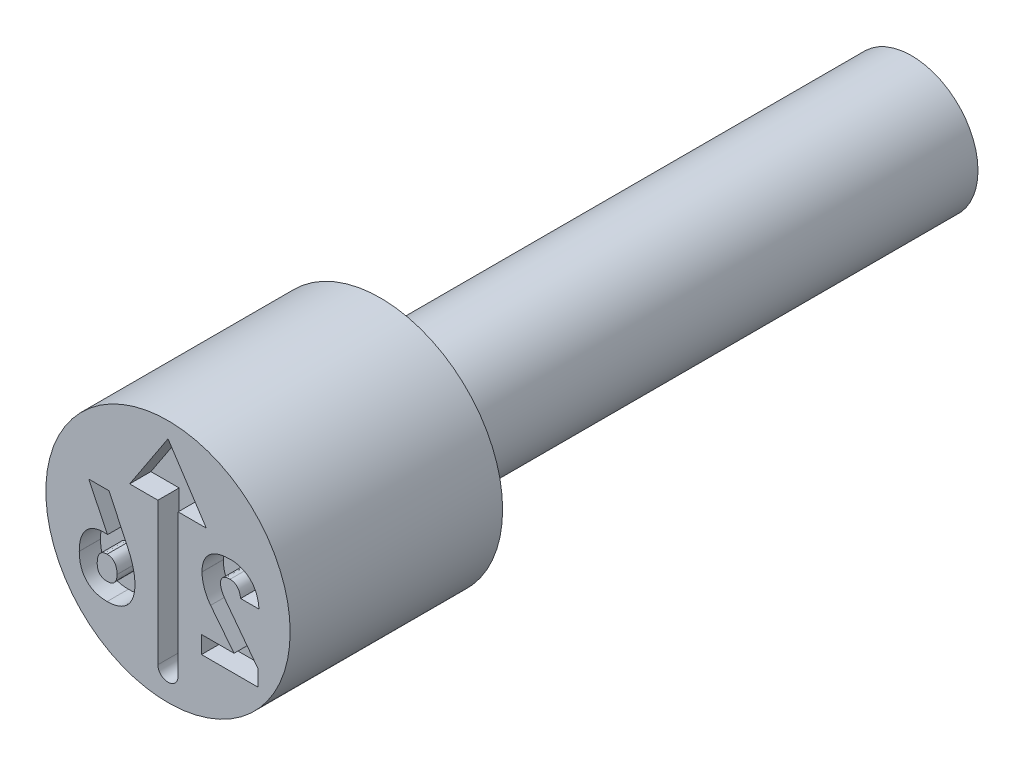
ISO-10303-21;
HEADER;
FILE_DESCRIPTION(('STEP AP214'),'2;1');
FILE_NAME('part.step','',(''),(''),'','','');
FILE_SCHEMA(('AUTOMOTIVE_DESIGN { 1 0 10303 214 1 1 1 1 }'));
ENDSEC;
DATA;
#1=APPLICATION_CONTEXT('core data for automotive mechanical design processes');
#2=APPLICATION_PROTOCOL_DEFINITION('international standard','automotive_design',2000,#1);
#3=PRODUCT_CONTEXT('',#1,'mechanical');
#4=PRODUCT('Part','Part','',(#3));
#5=PRODUCT_RELATED_PRODUCT_CATEGORY('part','',(#4));
#6=PRODUCT_DEFINITION_FORMATION('','',#4);
#7=PRODUCT_DEFINITION_CONTEXT('part definition',#1,'design');
#8=PRODUCT_DEFINITION('design','',#6,#7);
#9=PRODUCT_DEFINITION_SHAPE('','',#8);
#10=(LENGTH_UNIT() NAMED_UNIT(*) SI_UNIT(.MILLI.,.METRE.));
#11=(NAMED_UNIT(*) PLANE_ANGLE_UNIT() SI_UNIT($,.RADIAN.));
#12=(NAMED_UNIT(*) SI_UNIT($,.STERADIAN.) SOLID_ANGLE_UNIT());
#13=UNCERTAINTY_MEASURE_WITH_UNIT(LENGTH_MEASURE(1.E-05),#10,'distance_accuracy_value','');
#14=(GEOMETRIC_REPRESENTATION_CONTEXT(3) GLOBAL_UNCERTAINTY_ASSIGNED_CONTEXT((#13)) GLOBAL_UNIT_ASSIGNED_CONTEXT((#10,
#11,#12)) REPRESENTATION_CONTEXT('',''));
#15=CARTESIAN_POINT('',(0.,0.,0.));
#16=DIRECTION('',(0.,0.,1.));
#17=DIRECTION('',(1.,0.,0.));
#18=AXIS2_PLACEMENT_3D('',#15,#16,#17);
#19=CARTESIAN_POINT('',(0.,2.3,0.));
#20=DIRECTION('',(0.,0.,-1.));
#21=DIRECTION('',(-1.,0.,0.));
#22=AXIS2_PLACEMENT_3D('',#19,#20,#21);
#23=PLANE('',#22);
#24=DIRECTION('',(0.,1.,0.));
#25=VECTOR('',#24,1.);
#26=CARTESIAN_POINT('',(1.69085301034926,-1.2,0.));
#27=LINE('',#26,#25);
#28=CARTESIAN_POINT('',(1.69085301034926,-1.2,0.));
#29=VERTEX_POINT('',#28);
#30=CARTESIAN_POINT('',(1.69085301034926,-0.893912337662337,0.));
#31=VERTEX_POINT('',#30);
#32=EDGE_CURVE('E513',#29,#31,#27,.T.);
#33=ORIENTED_EDGE('',*,*,#32,.F.);
#34=DIRECTION('',(1.,0.,0.));
#35=VECTOR('',#34,1.);
#36=CARTESIAN_POINT('',(0.630869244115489,-1.2,0.));
#37=LINE('',#36,#35);
#38=CARTESIAN_POINT('',(0.630869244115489,-1.2,0.));
#39=VERTEX_POINT('',#38);
#40=EDGE_CURVE('E54',#39,#29,#37,.T.);
#41=ORIENTED_EDGE('',*,*,#40,.F.);
#42=DIRECTION('',(0.,-1.,0.));
#43=VECTOR('',#42,1.);
#44=CARTESIAN_POINT('',(0.630869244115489,-0.872727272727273,0.));
#45=LINE('',#44,#43);
#46=CARTESIAN_POINT('',(0.630869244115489,-0.872727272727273,0.));
#47=VERTEX_POINT('',#46);
#48=EDGE_CURVE('E317',#47,#39,#45,.T.);
#49=ORIENTED_EDGE('',*,*,#48,.F.);
#50=DIRECTION('',(-1.,0.,0.));
#51=VECTOR('',#50,1.);
#52=CARTESIAN_POINT('',(1.24340982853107,-0.872727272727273,0.));
#53=LINE('',#52,#51);
#54=CARTESIAN_POINT('',(1.24340982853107,-0.872727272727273,0.));
#55=VERTEX_POINT('',#54);
#56=EDGE_CURVE('E320',#55,#47,#53,.T.);
#57=ORIENTED_EDGE('',*,*,#56,.F.);
#58=DIRECTION('',(0.618183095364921,-0.786034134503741,0.));
#59=VECTOR('',#58,1.);
#60=CARTESIAN_POINT('',(0.802176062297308,-0.311688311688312,0.));
#61=LINE('',#60,#59);
#62=CARTESIAN_POINT('',(0.802176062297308,-0.311688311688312,0.));
#63=VERTEX_POINT('',#62);
#64=EDGE_CURVE('E1329',#63,#55,#61,.T.);
#65=ORIENTED_EDGE('',*,*,#64,.F.);
#66=CARTESIAN_POINT('',(0.640731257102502,0.151461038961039,0.));
#67=CARTESIAN_POINT('',(0.641196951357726,0.130980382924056,0.));
#68=CARTESIAN_POINT('',(0.642129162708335,0.0899828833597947,0.));
#69=CARTESIAN_POINT('',(0.65054386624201,0.0286244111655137,0.));
#70=CARTESIAN_POINT('',(0.66410399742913,-0.0324207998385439,0.));
#71=CARTESIAN_POINT('',(0.682726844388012,-0.0928578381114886,0.));
#72=CARTESIAN_POINT('',(0.705861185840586,-0.151639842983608,0.));
#73=CARTESIAN_POINT('',(0.733626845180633,-0.207961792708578,0.));
#74=CARTESIAN_POINT('',(0.764963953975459,-0.261848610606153,0.));
#75=CARTESIAN_POINT('',(0.789795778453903,-0.295106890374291,0.));
#76=CARTESIAN_POINT('',(0.802176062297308,-0.311688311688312,0.));
#77=B_SPLINE_CURVE_WITH_KNOTS('',3,(#66,#67,#68,#69,#70,#71,#72,#73,#74,#75,#76),.UNSPECIFIED.,
.F.,.F.,(4,1,1,1,1,1,1,1,4),(0.,0.123046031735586,0.246309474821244,0.371480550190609,
0.498560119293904,0.626024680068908,0.750715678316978,0.875715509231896,1.),.UNSPECIFIED.);
#78=CARTESIAN_POINT('',(0.640731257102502,0.151461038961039,0.));
#79=VERTEX_POINT('',#78);
#80=EDGE_CURVE('E1324',#79,#63,#77,.T.);
#81=ORIENTED_EDGE('',*,*,#80,.F.);
#82=DIRECTION('',(0.,-1.,0.));
#83=VECTOR('',#82,1.);
#84=CARTESIAN_POINT('',(0.640731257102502,0.152922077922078,0.));
#85=LINE('',#84,#83);
#86=CARTESIAN_POINT('',(0.640731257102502,0.152922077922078,0.));
#87=VERTEX_POINT('',#86);
#88=EDGE_CURVE('E1318',#87,#79,#85,.T.);
#89=ORIENTED_EDGE('',*,*,#88,.F.);
#90=CARTESIAN_POINT('',(1.17072314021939,0.623376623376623,0.));
#91=CARTESIAN_POINT('',(1.15025208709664,0.623085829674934,0.));
#92=CARTESIAN_POINT('',(1.11043859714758,0.622520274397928,0.));
#93=CARTESIAN_POINT('',(1.05247704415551,0.61641528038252,0.));
#94=CARTESIAN_POINT('',(0.997941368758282,0.607201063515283,0.));
#95=CARTESIAN_POINT('',(0.946919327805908,0.593721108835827,0.));
#96=CARTESIAN_POINT('',(0.899615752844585,0.576137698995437,0.));
#97=CARTESIAN_POINT('',(0.855888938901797,0.554936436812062,0.));
#98=CARTESIAN_POINT('',(0.815647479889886,0.529936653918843,0.));
#99=CARTESIAN_POINT('',(0.779199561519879,0.501084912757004,0.));
#100=CARTESIAN_POINT('',(0.746405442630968,0.468905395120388,0.));
#101=CARTESIAN_POINT('',(0.718178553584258,0.433071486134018,0.));
#102=CARTESIAN_POINT('',(0.693743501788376,0.3943075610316,0.));
#103=CARTESIAN_POINT('',(0.674642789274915,0.351861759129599,0.));
#104=CARTESIAN_POINT('',(0.658917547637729,0.306732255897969,0.));
#105=CARTESIAN_POINT('',(0.648735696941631,0.25811011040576,0.));
#106=CARTESIAN_POINT('',(0.641874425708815,0.206567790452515,0.));
#107=CARTESIAN_POINT('',(0.641118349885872,0.171087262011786,0.));
#108=CARTESIAN_POINT('',(0.640731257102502,0.152922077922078,0.));
#109=B_SPLINE_CURVE_WITH_KNOTS('',3,(#90,#91,#92,#93,#94,#95,#96,#97,#98,#99,#100,#101,#102,
#103,#104,#105,#106,#107,#108),.UNSPECIFIED.,.F.,.F.,(4,1,1,1,1,1,1,1,1,1,1,1,1,1,1,1,4),(0.,
0.0762312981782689,0.148259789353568,0.216860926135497,0.282100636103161,0.344528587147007,
0.404571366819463,0.462840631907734,0.520642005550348,0.577409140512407,0.633580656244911,
0.690215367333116,0.747647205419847,0.806597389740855,0.867894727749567,0.932365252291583,1.),.UNSPECIFIED.);
#110=CARTESIAN_POINT('',(1.17072314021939,0.623376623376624,0.));
#111=VERTEX_POINT('',#110);
#112=EDGE_CURVE('E1310',#111,#87,#109,.T.);
#113=ORIENTED_EDGE('',*,*,#112,.F.);
#114=CARTESIAN_POINT('',(1.7131338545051,0.0831574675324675,0.));
#115=CARTESIAN_POINT('',(1.71142524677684,0.10402199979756,0.));
#116=CARTESIAN_POINT('',(1.70809007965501,0.144749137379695,0.));
#117=CARTESIAN_POINT('',(1.69715595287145,0.203662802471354,0.));
#118=CARTESIAN_POINT('',(1.68302402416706,0.259155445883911,0.));
#119=CARTESIAN_POINT('',(1.66504630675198,0.311216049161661,0.));
#120=CARTESIAN_POINT('',(1.64194487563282,0.359241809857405,0.));
#121=CARTESIAN_POINT('',(1.61598971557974,0.404236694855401,0.));
#122=CARTESIAN_POINT('',(1.58477216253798,0.444809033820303,0.));
#123=CARTESIAN_POINT('',(1.55060017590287,0.482316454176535,0.));
#124=CARTESIAN_POINT('',(1.51253869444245,0.515352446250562,0.));
#125=CARTESIAN_POINT('',(1.47195469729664,0.544494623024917,0.));
#126=CARTESIAN_POINT('',(1.42823449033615,0.568745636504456,0.));
#127=CARTESIAN_POINT('',(1.3820427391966,0.588863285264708,0.));
#128=CARTESIAN_POINT('',(1.33286730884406,0.604132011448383,0.));
#129=CARTESIAN_POINT('',(1.28135054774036,0.615569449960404,0.));
#130=CARTESIAN_POINT('',(1.22690114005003,0.622165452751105,0.));
#131=CARTESIAN_POINT('',(1.18973429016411,0.622966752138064,0.));
#132=CARTESIAN_POINT('',(1.17072314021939,0.623376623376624,0.));
#133=B_SPLINE_CURVE_WITH_KNOTS('',3,(#114,#115,#116,#117,#118,#119,#120,#121,#122,#123,#124,
#125,#126,#127,#128,#129,#130,#131,#132),.UNSPECIFIED.,.F.,.F.,(4,1,1,1,1,1,1,1,1,1,1,1,1,1,1,1,
4),(0.,0.0733268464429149,0.14313249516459,0.209679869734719,0.273918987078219,0.33576228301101,
0.396210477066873,0.45560885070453,0.514796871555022,0.573764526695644,0.631900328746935,
0.689592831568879,0.748648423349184,0.808163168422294,0.86976604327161,0.933384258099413,1.),.UNSPECIFIED.);
#134=CARTESIAN_POINT('',(1.7131338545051,0.0831574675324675,0.));
#135=VERTEX_POINT('',#134);
#136=EDGE_CURVE('E1305',#135,#111,#133,.T.);
#137=ORIENTED_EDGE('',*,*,#136,.F.);
#138=DIRECTION('',(0.,1.,0.));
#139=VECTOR('',#138,1.);
#140=CARTESIAN_POINT('',(1.7131338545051,0.0820616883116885,0.));
#141=LINE('',#140,#139);
#142=CARTESIAN_POINT('',(1.7131338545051,0.0820616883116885,0.));
#143=VERTEX_POINT('',#142);
#144=EDGE_CURVE('E1302',#143,#135,#141,.T.);
#145=ORIENTED_EDGE('',*,*,#144,.F.);
#146=DIRECTION('',(1.,0.,0.));
#147=VECTOR('',#146,1.);
#148=CARTESIAN_POINT('',(1.36686762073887,0.0820616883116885,0.));
#149=LINE('',#148,#147);
#150=CARTESIAN_POINT('',(1.36686762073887,0.0820616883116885,0.));
#151=VERTEX_POINT('',#150);
#152=EDGE_CURVE('E1299',#151,#143,#149,.T.);
#153=ORIENTED_EDGE('',*,*,#152,.F.);
#154=DIRECTION('',(0.,-1.,0.));
#155=VECTOR('',#154,1.);
#156=CARTESIAN_POINT('',(1.36686762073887,0.0831574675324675,0.));
#157=LINE('',#156,#155);
#158=CARTESIAN_POINT('',(1.36686762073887,0.0831574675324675,0.));
#159=VERTEX_POINT('',#158);
#160=EDGE_CURVE('E1293',#159,#151,#157,.T.);
#161=ORIENTED_EDGE('',*,*,#160,.F.);
#162=CARTESIAN_POINT('',(1.16816632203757,0.296103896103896,0.));
#163=CARTESIAN_POINT('',(1.18139896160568,0.295587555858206,0.));
#164=CARTESIAN_POINT('',(1.20711044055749,0.294584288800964,0.));
#165=CARTESIAN_POINT('',(1.24350942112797,0.283465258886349,0.));
#166=CARTESIAN_POINT('',(1.27630845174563,0.266024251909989,0.));
#167=CARTESIAN_POINT('',(1.30458382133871,0.241138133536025,0.));
#168=CARTESIAN_POINT('',(1.32799796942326,0.20989267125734,0.));
#169=CARTESIAN_POINT('',(1.34700081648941,0.173098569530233,0.));
#170=CARTESIAN_POINT('',(1.35990740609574,0.130091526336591,0.));
#171=CARTESIAN_POINT('',(1.36447289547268,0.0993055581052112,0.));
#172=CARTESIAN_POINT('',(1.36686762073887,0.0831574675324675,0.));
#173=B_SPLINE_CURVE_WITH_KNOTS('',3,(#162,#163,#164,#165,#166,#167,#168,#169,#170,#171,#172),
.UNSPECIFIED.,.F.,.F.,(4,1,1,1,1,1,1,1,4),(0.,0.122603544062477,0.238222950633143,
0.350089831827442,0.46555970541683,0.585028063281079,0.711014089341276,0.848418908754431,1.),.UNSPECIFIED.);
#174=CARTESIAN_POINT('',(1.16816632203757,0.296103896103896,0.));
#175=VERTEX_POINT('',#174);
#176=EDGE_CURVE('E1285',#175,#159,#173,.T.);
#177=ORIENTED_EDGE('',*,*,#176,.F.);
#178=CARTESIAN_POINT('',(0.988458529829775,0.143425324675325,0.));
#179=CARTESIAN_POINT('',(0.988957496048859,0.154934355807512,0.));
#180=CARTESIAN_POINT('',(0.989913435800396,0.17698382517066,0.));
#181=CARTESIAN_POINT('',(0.99891988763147,0.208051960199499,0.));
#182=CARTESIAN_POINT('',(1.01368097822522,0.235107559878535,0.));
#183=CARTESIAN_POINT('',(1.03482242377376,0.257455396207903,0.));
#184=CARTESIAN_POINT('',(1.06114190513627,0.275131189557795,0.));
#185=CARTESIAN_POINT('',(1.09263389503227,0.287588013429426,0.));
#186=CARTESIAN_POINT('',(1.12888634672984,0.294731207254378,0.));
#187=CARTESIAN_POINT('',(1.15461820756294,0.295630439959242,0.));
#188=CARTESIAN_POINT('',(1.16816632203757,0.296103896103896,0.));
#189=B_SPLINE_CURVE_WITH_KNOTS('',3,(#178,#179,#180,#181,#182,#183,#184,#185,#186,#187,#188),
.UNSPECIFIED.,.F.,.F.,(4,1,1,1,1,1,1,1,4),(0.,0.128749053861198,0.246662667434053,
0.359069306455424,0.47107757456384,0.588039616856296,0.711712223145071,0.848213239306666,1.),.UNSPECIFIED.);
#190=CARTESIAN_POINT('',(0.988458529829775,0.143425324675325,0.));
#191=VERTEX_POINT('',#190);
#192=EDGE_CURVE('E1280',#191,#175,#189,.T.);
#193=ORIENTED_EDGE('',*,*,#192,.F.);
#194=DIRECTION('',(0.,1.,0.));
#195=VECTOR('',#194,1.);
#196=CARTESIAN_POINT('',(0.988458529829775,0.140868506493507,0.));
#197=LINE('',#196,#195);
#198=CARTESIAN_POINT('',(0.988458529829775,0.140868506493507,0.));
#199=VERTEX_POINT('',#198);
#200=EDGE_CURVE('E1274',#199,#191,#197,.T.);
#201=ORIENTED_EDGE('',*,*,#200,.F.);
#202=CARTESIAN_POINT('',(1.07575560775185,-0.0790178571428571,0.));
#203=CARTESIAN_POINT('',(1.06287228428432,-0.0608645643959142,0.));
#204=CARTESIAN_POINT('',(1.03776951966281,-0.0254934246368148,0.));
#205=CARTESIAN_POINT('',(1.01504958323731,0.0230816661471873,0.));
#206=CARTESIAN_POINT('',(1.0008960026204,0.0611651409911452,0.));
#207=CARTESIAN_POINT('',(0.994150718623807,0.0887831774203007,0.));
#208=CARTESIAN_POINT('',(0.989338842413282,0.115133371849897,0.));
#209=CARTESIAN_POINT('',(0.988746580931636,0.132447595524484,0.));
#210=CARTESIAN_POINT('',(0.988458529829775,0.140868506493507,0.));
#211=B_SPLINE_CURVE_WITH_KNOTS('',3,(#202,#203,#204,#205,#206,#207,#208,#209,#210),
.UNSPECIFIED.,.F.,.F.,(4,1,1,1,1,1,4),(0.,0.27737542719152,0.540457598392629,0.666416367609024,
0.784009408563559,0.894951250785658,1.),.UNSPECIFIED.);
#212=CARTESIAN_POINT('',(1.07575560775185,-0.0790178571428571,0.));
#213=VERTEX_POINT('',#212);
#214=EDGE_CURVE('E1269',#213,#199,#211,.T.);
#215=ORIENTED_EDGE('',*,*,#214,.F.);
#216=DIRECTION('',(-0.602458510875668,0.798150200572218,0.));
#217=VECTOR('',#216,1.);
#218=CARTESIAN_POINT('',(1.69085301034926,-0.893912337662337,0.));
#219=LINE('',#218,#217);
#220=EDGE_CURVE('E1266',#31,#213,#219,.T.);
#221=ORIENTED_EDGE('',*,*,#220,.F.);
#222=EDGE_LOOP('',(#33,#41,#49,#57,#65,#81,#89,#113,#137,#145,#153,#161,#177,#193,#201,#215,#221));
#223=FACE_BOUND('',#222,.T.);
#224=CARTESIAN_POINT('',(-1.1457687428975,-1.22337662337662,0.));
#225=CARTESIAN_POINT('',(-1.12554073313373,-1.22297088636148,0.));
#226=CARTESIAN_POINT('',(-1.08618963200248,-1.22218157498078,0.));
#227=CARTESIAN_POINT('',(-1.02894455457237,-1.21563712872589,0.));
#228=CARTESIAN_POINT('',(-0.975285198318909,-1.20426977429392,0.));
#229=CARTESIAN_POINT('',(-0.924975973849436,-1.18858209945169,0.));
#230=CARTESIAN_POINT('',(-0.878015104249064,-1.16852861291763,0.));
#231=CARTESIAN_POINT('',(-0.834610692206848,-1.14394324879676,0.));
#232=CARTESIAN_POINT('',(-0.794741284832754,-1.11480868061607,0.));
#233=CARTESIAN_POINT('',(-0.758608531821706,-1.08118784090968,0.));
#234=CARTESIAN_POINT('',(-0.726466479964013,-1.04350012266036,0.));
#235=CARTESIAN_POINT('',(-0.698391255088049,-1.00211366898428,0.));
#236=CARTESIAN_POINT('',(-0.674619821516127,-0.957041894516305,0.));
#237=CARTESIAN_POINT('',(-0.655340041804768,-0.908261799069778,0.));
#238=CARTESIAN_POINT('',(-0.64021822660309,-0.855923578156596,0.));
#239=CARTESIAN_POINT('',(-0.62999064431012,-0.799991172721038,0.));
#240=CARTESIAN_POINT('',(-0.623102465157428,-0.740430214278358,0.));
#241=CARTESIAN_POINT('',(-0.622365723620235,-0.699493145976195,0.));
#242=CARTESIAN_POINT('',(-0.621986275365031,-0.678409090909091,0.));
#243=B_SPLINE_CURVE_WITH_KNOTS('',3,(#224,#225,#226,#227,#228,#229,#230,#231,#232,#233,#234,
#235,#236,#237,#238,#239,#240,#241,#242),.UNSPECIFIED.,.F.,.F.,(4,1,1,1,1,1,1,1,1,1,1,1,1,1,1,1,
4),(0.,0.0706034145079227,0.137350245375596,0.20079014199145,0.261822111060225,
0.321037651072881,0.378713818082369,0.435588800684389,0.493032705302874,0.550614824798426,
0.60814515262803,0.667276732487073,0.728130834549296,0.790952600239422,0.857142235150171,
0.926423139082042,1.),.UNSPECIFIED.);
#244=CARTESIAN_POINT('',(-1.1457687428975,-1.22337662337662,0.));
#245=VERTEX_POINT('',#244);
#246=CARTESIAN_POINT('',(-0.621986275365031,-0.678409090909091,0.));
#247=VERTEX_POINT('',#246);
#248=EDGE_CURVE('E518',#245,#247,#243,.T.);
#249=ORIENTED_EDGE('',*,*,#248,.F.);
#250=CARTESIAN_POINT('',(-1.671012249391,-0.668547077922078,0.));
#251=CARTESIAN_POINT('',(-1.67061940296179,-0.689872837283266,0.));
#252=CARTESIAN_POINT('',(-1.66985194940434,-0.731534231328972,0.));
#253=CARTESIAN_POINT('',(-1.66308238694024,-0.792083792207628,0.));
#254=CARTESIAN_POINT('',(-1.65270997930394,-0.849077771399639,0.));
#255=CARTESIAN_POINT('',(-1.63773521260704,-0.902306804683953,0.));
#256=CARTESIAN_POINT('',(-1.61836463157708,-0.951903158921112,0.));
#257=CARTESIAN_POINT('',(-1.59456816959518,-0.99788357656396,0.));
#258=CARTESIAN_POINT('',(-1.56623634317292,-1.04002112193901,0.));
#259=CARTESIAN_POINT('',(-1.53417491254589,-1.07862131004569,0.));
#260=CARTESIAN_POINT('',(-1.49778734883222,-1.11258783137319,0.));
#261=CARTESIAN_POINT('',(-1.45804959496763,-1.14243331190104,0.));
#262=CARTESIAN_POINT('',(-1.41482181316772,-1.16793328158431,0.));
#263=CARTESIAN_POINT('',(-1.36746401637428,-1.18777027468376,0.));
#264=CARTESIAN_POINT('',(-1.31705961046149,-1.20405412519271,0.));
#265=CARTESIAN_POINT('',(-1.2629148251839,-1.21511521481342,0.));
#266=CARTESIAN_POINT('',(-1.20550078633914,-1.22230637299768,0.));
#267=CARTESIAN_POINT('',(-1.16600274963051,-1.22301408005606,0.));
#268=CARTESIAN_POINT('',(-1.1457687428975,-1.22337662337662,0.));
#269=B_SPLINE_CURVE_WITH_KNOTS('',3,(#250,#251,#252,#253,#254,#255,#256,#257,#258,#259,#260,
#261,#262,#263,#264,#265,#266,#267,#268),.UNSPECIFIED.,.F.,.F.,(4,1,1,1,1,1,1,1,1,1,1,1,1,1,1,1,
4),(0.,0.0736363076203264,0.143853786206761,0.210167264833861,0.273535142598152,
0.334525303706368,0.393774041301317,0.451974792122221,0.509587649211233,0.566708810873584,
0.623480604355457,0.68096439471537,0.739551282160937,0.800463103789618,0.863640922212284,
0.930146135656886,1.),.UNSPECIFIED.);
#270=CARTESIAN_POINT('',(-1.671012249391,-0.668547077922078,0.));
#271=VERTEX_POINT('',#270);
#272=EDGE_CURVE('E62',#271,#245,#269,.T.);
#273=ORIENTED_EDGE('',*,*,#272,.F.);
#274=DIRECTION('',(0.,-1.,0.));
#275=VECTOR('',#274,1.);
#276=CARTESIAN_POINT('',(-1.671012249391,-0.667086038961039,0.));
#277=LINE('',#276,#275);
#278=CARTESIAN_POINT('',(-1.671012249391,-0.667086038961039,0.));
#279=VERTEX_POINT('',#278);
#280=EDGE_CURVE('E438',#279,#271,#277,.T.);
#281=ORIENTED_EDGE('',*,*,#280,.F.);
#282=CARTESIAN_POINT('',(-1.2038450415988,-0.124675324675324,0.));
#283=CARTESIAN_POINT('',(-1.22188247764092,-0.125084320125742,0.));
#284=CARTESIAN_POINT('',(-1.25698790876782,-0.125880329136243,0.));
#285=CARTESIAN_POINT('',(-1.30806927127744,-0.132392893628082,0.));
#286=CARTESIAN_POINT('',(-1.3558086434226,-0.143933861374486,0.));
#287=CARTESIAN_POINT('',(-1.40080698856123,-0.159083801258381,0.));
#288=CARTESIAN_POINT('',(-1.44259187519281,-0.179286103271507,0.));
#289=CARTESIAN_POINT('',(-1.48126693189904,-0.204005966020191,0.));
#290=CARTESIAN_POINT('',(-1.51692230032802,-0.232947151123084,0.));
#291=CARTESIAN_POINT('',(-1.54908806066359,-0.266457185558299,0.));
#292=CARTESIAN_POINT('',(-1.57806585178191,-0.303681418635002,0.));
#293=CARTESIAN_POINT('',(-1.60289863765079,-0.344995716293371,0.));
#294=CARTESIAN_POINT('',(-1.62423922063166,-0.389709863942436,0.));
#295=CARTESIAN_POINT('',(-1.64124066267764,-0.438270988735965,0.));
#296=CARTESIAN_POINT('',(-1.65486655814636,-0.490284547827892,0.));
#297=CARTESIAN_POINT('',(-1.66406705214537,-0.546045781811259,0.));
#298=CARTESIAN_POINT('',(-1.67015168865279,-0.605343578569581,0.));
#299=CARTESIAN_POINT('',(-1.67072014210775,-0.646128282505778,0.));
#300=CARTESIAN_POINT('',(-1.671012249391,-0.667086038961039,0.));
#301=B_SPLINE_CURVE_WITH_KNOTS('',3,(#282,#283,#284,#285,#286,#287,#288,#289,#290,#291,#292,
#293,#294,#295,#296,#297,#298,#299,#300),.UNSPECIFIED.,.F.,.F.,(4,1,1,1,1,1,1,1,1,1,1,1,1,1,1,1,
4),(0.,0.0665766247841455,0.129575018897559,0.189644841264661,0.24763903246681,0.30453064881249,
0.360514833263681,0.416743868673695,0.473642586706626,0.531631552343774,0.590524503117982,
0.65124161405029,0.714220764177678,0.780176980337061,0.849489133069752,0.922658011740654,1.),.UNSPECIFIED.);
#302=CARTESIAN_POINT('',(-1.2038450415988,-0.124675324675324,0.));
#303=VERTEX_POINT('',#302);
#304=EDGE_CURVE('E619',#303,#279,#301,.T.);
#305=ORIENTED_EDGE('',*,*,#304,.F.);
#306=CARTESIAN_POINT('',(-0.975557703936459,-0.247402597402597,0.));
#307=CARTESIAN_POINT('',(-0.981091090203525,-0.237573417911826,0.));
#308=CARTESIAN_POINT('',(-0.991935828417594,-0.218309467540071,0.));
#309=CARTESIAN_POINT('',(-1.01329830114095,-0.193377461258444,0.));
#310=CARTESIAN_POINT('',(-1.03712369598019,-0.171726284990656,0.));
#311=CARTESIAN_POINT('',(-1.0646781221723,-0.154505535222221,0.));
#312=CARTESIAN_POINT('',(-1.09514469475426,-0.140881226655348,0.));
#313=CARTESIAN_POINT('',(-1.12877260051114,-0.131593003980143,0.));
#314=CARTESIAN_POINT('',(-1.16527119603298,-0.125499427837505,0.));
#315=CARTESIAN_POINT('',(-1.19066896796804,-0.124956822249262,0.));
#316=CARTESIAN_POINT('',(-1.2038450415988,-0.124675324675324,0.));
#317=B_SPLINE_CURVE_WITH_KNOTS('',3,(#306,#307,#308,#309,#310,#311,#312,#313,#314,#315,#316),
.UNSPECIFIED.,.F.,.F.,(4,1,1,1,1,1,1,1,4),(0.,0.123274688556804,0.241602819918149,
0.357777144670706,0.474683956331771,0.595870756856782,0.722082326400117,0.855819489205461,1.),.UNSPECIFIED.);
#318=CARTESIAN_POINT('',(-1.13891907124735,-0.130151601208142,0.));
#319=VERTEX_POINT('',#318);
#320=EDGE_CURVE('E624',#319,#303,#317,.T.);
#321=ORIENTED_EDGE('',*,*,#320,.F.);
#322=DIRECTION('',(0.435377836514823,-0.900247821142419,0.));
#323=VECTOR('',#322,1.);
#324=CARTESIAN_POINT('',(-1.49203497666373,0.6,0.));
#325=LINE('',#324,#323);
#326=CARTESIAN_POINT('',(-1.49203497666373,0.6,0.));
#327=VERTEX_POINT('',#326);
#328=EDGE_CURVE('E632',#327,#319,#325,.T.);
#329=ORIENTED_EDGE('',*,*,#328,.F.);
#330=DIRECTION('',(-1.,0.,0.));
#331=VECTOR('',#330,1.);
#332=CARTESIAN_POINT('',(-1.10997328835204,0.6,0.));
#333=LINE('',#332,#331);
#334=CARTESIAN_POINT('',(-1.10997328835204,0.6,0.));
#335=VERTEX_POINT('',#334);
#336=EDGE_CURVE('E638',#335,#327,#333,.T.);
#337=ORIENTED_EDGE('',*,*,#336,.F.);
#338=DIRECTION('',(-0.424073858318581,0.905627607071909,0.));
#339=VECTOR('',#338,1.);
#340=CARTESIAN_POINT('',(-0.746174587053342,-0.176907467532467,0.));
#341=LINE('',#340,#339);
#342=CARTESIAN_POINT('',(-0.746174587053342,-0.176907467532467,0.));
#343=VERTEX_POINT('',#342);
#344=EDGE_CURVE('E641',#343,#335,#341,.T.);
#345=ORIENTED_EDGE('',*,*,#344,.F.);
#346=CARTESIAN_POINT('',(-0.621986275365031,-0.677313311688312,0.));
#347=CARTESIAN_POINT('',(-0.622447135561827,-0.657573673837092,0.));
#348=CARTESIAN_POINT('',(-0.62338520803,-0.617394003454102,0.));
#349=CARTESIAN_POINT('',(-0.629927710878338,-0.556410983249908,0.));
#350=CARTESIAN_POINT('',(-0.640036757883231,-0.493796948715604,0.));
#351=CARTESIAN_POINT('',(-0.654864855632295,-0.43011222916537,0.));
#352=CARTESIAN_POINT('',(-0.672945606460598,-0.366008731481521,0.));
#353=CARTESIAN_POINT('',(-0.694364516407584,-0.302224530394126,0.));
#354=CARTESIAN_POINT('',(-0.718181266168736,-0.238909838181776,0.));
#355=CARTESIAN_POINT('',(-0.736817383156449,-0.197632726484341,0.));
#356=CARTESIAN_POINT('',(-0.746174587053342,-0.176907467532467,0.));
#357=B_SPLINE_CURVE_WITH_KNOTS('',3,(#346,#347,#348,#349,#350,#351,#352,#353,#354,#355,#356),
.UNSPECIFIED.,.F.,.F.,(4,1,1,1,1,1,1,1,4),(0.,0.114002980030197,0.232050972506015,
0.353906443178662,0.480147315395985,0.609491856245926,0.73847457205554,0.868687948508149,1.),.UNSPECIFIED.);
#358=CARTESIAN_POINT('',(-0.621986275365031,-0.677313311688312,0.));
#359=VERTEX_POINT('',#358);
#360=EDGE_CURVE('E644',#359,#343,#357,.T.);
#361=ORIENTED_EDGE('',*,*,#360,.F.);
#362=DIRECTION('',(0.,1.,0.));
#363=VECTOR('',#362,1.);
#364=CARTESIAN_POINT('',(-0.621986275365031,-0.678409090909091,0.));
#365=LINE('',#364,#363);
#366=EDGE_CURVE('E649',#247,#359,#365,.T.);
#367=ORIENTED_EDGE('',*,*,#366,.F.);
#368=EDGE_LOOP('',(#249,#273,#281,#305,#321,#329,#337,#345,#361,#367));
#369=FACE_BOUND('',#368,.T.);
#370=CARTESIAN_POINT('',(0.,0.,0.));
#371=DIRECTION('',(0.,0.,1.));
#372=DIRECTION('',(1.,0.,0.));
#373=AXIS2_PLACEMENT_3D('',#370,#371,#372);
#374=CIRCLE('',#373,2.3);
#375=CARTESIAN_POINT('',(2.3,0.,0.));
#376=VERTEX_POINT('',#375);
#377=EDGE_CURVE('E47',#376,#376,#374,.T.);
#378=ORIENTED_EDGE('',*,*,#377,.T.);
#379=EDGE_LOOP('',(#378));
#380=FACE_BOUND('',#379,.T.);
#381=DIRECTION('',(0.,1.,0.));
#382=VECTOR('',#381,1.);
#383=CARTESIAN_POINT('',(0.190473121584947,0.906351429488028,0.));
#384=LINE('',#383,#382);
#385=CARTESIAN_POINT('',(0.190473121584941,-1.77616183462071,0.));
#386=VERTEX_POINT('',#385);
#387=CARTESIAN_POINT('',(0.190473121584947,0.906351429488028,0.));
#388=VERTEX_POINT('',#387);
#389=EDGE_CURVE('E525',#386,#388,#384,.T.);
#390=ORIENTED_EDGE('',*,*,#389,.F.);
#391=CARTESIAN_POINT('',(1.6342449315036E-13,-1.77616183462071,0.));
#392=DIRECTION('',(0.,0.,1.));
#393=DIRECTION('',(1.,0.,0.));
#394=AXIS2_PLACEMENT_3D('',#391,#392,#393);
#395=CIRCLE('',#394,0.190473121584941);
#396=CARTESIAN_POINT('',(-0.190473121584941,-1.77616183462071,0.));
#397=VERTEX_POINT('',#396);
#398=EDGE_CURVE('E527',#397,#386,#395,.T.);
#399=ORIENTED_EDGE('',*,*,#398,.F.);
#400=DIRECTION('',(0.,-1.,0.));
#401=VECTOR('',#400,1.);
#402=CARTESIAN_POINT('',(-0.190473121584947,0.906351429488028,0.));
#403=LINE('',#402,#401);
#404=CARTESIAN_POINT('',(-0.190473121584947,0.906351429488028,0.));
#405=VERTEX_POINT('',#404);
#406=EDGE_CURVE('E547',#405,#397,#403,.T.);
#407=ORIENTED_EDGE('',*,*,#406,.F.);
#408=DIRECTION('',(1.,0.,0.));
#409=VECTOR('',#408,1.);
#410=CARTESIAN_POINT('',(-0.721917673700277,0.906351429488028,0.));
#411=LINE('',#410,#409);
#412=CARTESIAN_POINT('',(-0.721917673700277,0.906351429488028,0.));
#413=VERTEX_POINT('',#412);
#414=EDGE_CURVE('E544',#413,#405,#411,.T.);
#415=ORIENTED_EDGE('',*,*,#414,.F.);
#416=DIRECTION('',(-0.550159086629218,-0.835059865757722,0.));
#417=VECTOR('',#416,1.);
#418=CARTESIAN_POINT('',(0.,2.00211534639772,0.));
#419=LINE('',#418,#417);
#420=CARTESIAN_POINT('',(0.,2.00211534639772,0.));
#421=VERTEX_POINT('',#420);
#422=EDGE_CURVE('E541',#421,#413,#419,.T.);
#423=ORIENTED_EDGE('',*,*,#422,.F.);
#424=DIRECTION('',(-0.550159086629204,0.835059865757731,0.));
#425=VECTOR('',#424,1.);
#426=CARTESIAN_POINT('',(0.,2.00211534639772,0.));
#427=LINE('',#426,#425);
#428=CARTESIAN_POINT('',(0.721917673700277,0.906351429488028,0.));
#429=VERTEX_POINT('',#428);
#430=EDGE_CURVE('E533',#429,#421,#427,.T.);
#431=ORIENTED_EDGE('',*,*,#430,.F.);
#432=DIRECTION('',(1.,0.,0.));
#433=VECTOR('',#432,1.);
#434=CARTESIAN_POINT('',(0.721917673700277,0.906351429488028,0.));
#435=LINE('',#434,#433);
#436=EDGE_CURVE('E530',#388,#429,#435,.T.);
#437=ORIENTED_EDGE('',*,*,#436,.F.);
#438=EDGE_LOOP('',(#390,#399,#407,#415,#423,#431,#437));
#439=FACE_BOUND('',#438,.T.);
#440=ADVANCED_FACE('F39',(#223,#369,#380,#439),#23,.F.);
#441=CARTESIAN_POINT('',(0.,1.25,-4.));
#442=DIRECTION('',(0.,0.,1.));
#443=DIRECTION('',(1.,0.,0.));
#444=AXIS2_PLACEMENT_3D('',#441,#442,#443);
#445=PLANE('',#444);
#446=CARTESIAN_POINT('',(0.,0.,-4.));
#447=DIRECTION('',(0.,0.,1.));
#448=DIRECTION('',(1.,0.,0.));
#449=AXIS2_PLACEMENT_3D('',#446,#447,#448);
#450=CIRCLE('',#449,2.3);
#451=CARTESIAN_POINT('',(2.3,0.,-4.));
#452=VERTEX_POINT('',#451);
#453=EDGE_CURVE('E11',#452,#452,#450,.T.);
#454=ORIENTED_EDGE('',*,*,#453,.F.);
#455=EDGE_LOOP('',(#454));
#456=FACE_BOUND('',#455,.T.);
#457=CARTESIAN_POINT('',(0.,0.,-4.));
#458=DIRECTION('',(0.,0.,1.));
#459=DIRECTION('',(1.,0.,0.));
#460=AXIS2_PLACEMENT_3D('',#457,#458,#459);
#461=CIRCLE('',#460,1.25);
#462=CARTESIAN_POINT('',(1.25,0.,-4.));
#463=VERTEX_POINT('',#462);
#464=EDGE_CURVE('E553',#463,#463,#461,.T.);
#465=ORIENTED_EDGE('',*,*,#464,.T.);
#466=EDGE_LOOP('',(#465));
#467=FACE_BOUND('',#466,.T.);
#468=ADVANCED_FACE('F41',(#456,#467),#445,.F.);
#469=CARTESIAN_POINT('',(0.,0.,-0.403888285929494));
#470=DIRECTION('',(0.,0.,1.));
#471=DIRECTION('',(1.,0.,0.));
#472=AXIS2_PLACEMENT_3D('',#469,#470,#471);
#473=CYLINDRICAL_SURFACE('',#472,2.3);
#474=ORIENTED_EDGE('',*,*,#377,.F.);
#475=EDGE_LOOP('',(#474));
#476=FACE_BOUND('',#475,.T.);
#477=ORIENTED_EDGE('',*,*,#453,.T.);
#478=EDGE_LOOP('',(#477));
#479=FACE_BOUND('',#478,.T.);
#480=ADVANCED_FACE('F494',(#476,#479),#473,.T.);
#481=CARTESIAN_POINT('',(0.,0.,-14.));
#482=DIRECTION('',(0.,0.,1.));
#483=DIRECTION('',(1.,0.,0.));
#484=AXIS2_PLACEMENT_3D('',#481,#482,#483);
#485=PLANE('',#484);
#486=CARTESIAN_POINT('',(0.,0.,-14.));
#487=DIRECTION('',(0.,0.,1.));
#488=DIRECTION('',(1.,0.,0.));
#489=AXIS2_PLACEMENT_3D('',#486,#487,#488);
#490=CIRCLE('',#489,1.25);
#491=CARTESIAN_POINT('',(1.25,0.,-14.));
#492=VERTEX_POINT('',#491);
#493=EDGE_CURVE('E569',#492,#492,#490,.T.);
#494=ORIENTED_EDGE('',*,*,#493,.F.);
#495=EDGE_LOOP('',(#494));
#496=FACE_BOUND('',#495,.T.);
#497=ADVANCED_FACE('F490',(#496),#485,.F.);
#498=CARTESIAN_POINT('',(0.,0.,-0.403888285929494));
#499=DIRECTION('',(0.,0.,1.));
#500=DIRECTION('',(1.,0.,0.));
#501=AXIS2_PLACEMENT_3D('',#498,#499,#500);
#502=CYLINDRICAL_SURFACE('',#501,1.25);
#503=ORIENTED_EDGE('',*,*,#464,.F.);
#504=EDGE_LOOP('',(#503));
#505=FACE_BOUND('',#504,.T.);
#506=ORIENTED_EDGE('',*,*,#493,.T.);
#507=EDGE_LOOP('',(#506));
#508=FACE_BOUND('',#507,.T.);
#509=ADVANCED_FACE('F486',(#505,#508),#502,.T.);
#510=CARTESIAN_POINT('',(1.6342449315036E-13,-1.77616183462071,-0.4));
#511=DIRECTION('',(0.,0.,1.));
#512=DIRECTION('',(1.,0.,0.));
#513=AXIS2_PLACEMENT_3D('',#510,#511,#512);
#514=CYLINDRICAL_SURFACE('',#513,0.190473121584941);
#515=ORIENTED_EDGE('',*,*,#398,.T.);
#516=DIRECTION('',(0.,0.,1.));
#517=VECTOR('',#516,1.);
#518=CARTESIAN_POINT('',(0.190473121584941,-1.77616183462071,-0.4));
#519=LINE('',#518,#517);
#520=CARTESIAN_POINT('',(0.190473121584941,-1.77616183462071,-0.4));
#521=VERTEX_POINT('',#520);
#522=EDGE_CURVE('E564',#521,#386,#519,.T.);
#523=ORIENTED_EDGE('',*,*,#522,.F.);
#524=CARTESIAN_POINT('',(1.6342449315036E-13,-1.77616183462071,-0.4));
#525=DIRECTION('',(0.,0.,1.));
#526=DIRECTION('',(1.,0.,0.));
#527=AXIS2_PLACEMENT_3D('',#524,#525,#526);
#528=CIRCLE('',#527,0.190473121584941);
#529=CARTESIAN_POINT('',(-0.190473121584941,-1.77616183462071,-0.4));
#530=VERTEX_POINT('',#529);
#531=EDGE_CURVE('E550',#530,#521,#528,.T.);
#532=ORIENTED_EDGE('',*,*,#531,.F.);
#533=DIRECTION('',(0.,0.,1.));
#534=VECTOR('',#533,1.);
#535=CARTESIAN_POINT('',(-0.190473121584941,-1.77616183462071,-0.4));
#536=LINE('',#535,#534);
#537=EDGE_CURVE('E551',#530,#397,#536,.T.);
#538=ORIENTED_EDGE('',*,*,#537,.T.);
#539=EDGE_LOOP('',(#515,#523,#532,#538));
#540=FACE_BOUND('',#539,.T.);
#541=ADVANCED_FACE('F464',(#540),#514,.F.);
#542=CARTESIAN_POINT('',(-0.190473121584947,0.906351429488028,-0.4));
#543=DIRECTION('',(-1.,0.,0.));
#544=DIRECTION('',(0.,-1.,0.));
#545=AXIS2_PLACEMENT_3D('',#542,#543,#544);
#546=PLANE('',#545);
#547=ORIENTED_EDGE('',*,*,#406,.T.);
#548=ORIENTED_EDGE('',*,*,#537,.F.);
#549=DIRECTION('',(0.,-1.,0.));
#550=VECTOR('',#549,1.);
#551=CARTESIAN_POINT('',(-0.190473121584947,0.906351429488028,-0.4));
#552=LINE('',#551,#550);
#553=CARTESIAN_POINT('',(-0.190473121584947,0.906351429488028,-0.4));
#554=VERTEX_POINT('',#553);
#555=EDGE_CURVE('E566',#554,#530,#552,.T.);
#556=ORIENTED_EDGE('',*,*,#555,.F.);
#557=DIRECTION('',(0.,0.,1.));
#558=VECTOR('',#557,1.);
#559=CARTESIAN_POINT('',(-0.190473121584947,0.906351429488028,-0.4));
#560=LINE('',#559,#558);
#561=EDGE_CURVE('E554',#554,#405,#560,.T.);
#562=ORIENTED_EDGE('',*,*,#561,.T.);
#563=EDGE_LOOP('',(#547,#548,#556,#562));
#564=FACE_BOUND('',#563,.T.);
#565=ADVANCED_FACE('F460',(#564),#546,.F.);
#566=CARTESIAN_POINT('',(-0.721917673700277,0.906351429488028,-0.4));
#567=DIRECTION('',(0.,-1.,0.));
#568=DIRECTION('',(0.,0.,-1.));
#569=AXIS2_PLACEMENT_3D('',#566,#567,#568);
#570=PLANE('',#569);
#571=ORIENTED_EDGE('',*,*,#414,.T.);
#572=ORIENTED_EDGE('',*,*,#561,.F.);
#573=DIRECTION('',(1.,0.,0.));
#574=VECTOR('',#573,1.);
#575=CARTESIAN_POINT('',(-0.721917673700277,0.906351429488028,-0.4));
#576=LINE('',#575,#574);
#577=CARTESIAN_POINT('',(-0.721917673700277,0.906351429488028,-0.4));
#578=VERTEX_POINT('',#577);
#579=EDGE_CURVE('E577',#578,#554,#576,.T.);
#580=ORIENTED_EDGE('',*,*,#579,.F.);
#581=DIRECTION('',(0.,0.,1.));
#582=VECTOR('',#581,1.);
#583=CARTESIAN_POINT('',(-0.721917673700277,0.906351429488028,-0.4));
#584=LINE('',#583,#582);
#585=EDGE_CURVE('E556',#578,#413,#584,.T.);
#586=ORIENTED_EDGE('',*,*,#585,.T.);
#587=EDGE_LOOP('',(#571,#572,#580,#586));
#588=FACE_BOUND('',#587,.T.);
#589=ADVANCED_FACE('F463',(#588),#570,.F.);
#590=CARTESIAN_POINT('',(0.,2.00211534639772,-0.4));
#591=DIRECTION('',(-0.835059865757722,0.550159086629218,0.));
#592=DIRECTION('',(-0.550159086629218,-0.835059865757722,0.));
#593=AXIS2_PLACEMENT_3D('',#590,#591,#592);
#594=PLANE('',#593);
#595=ORIENTED_EDGE('',*,*,#422,.T.);
#596=ORIENTED_EDGE('',*,*,#585,.F.);
#597=DIRECTION('',(-0.550159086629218,-0.835059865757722,0.));
#598=VECTOR('',#597,1.);
#599=CARTESIAN_POINT('',(0.,2.00211534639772,-0.4));
#600=LINE('',#599,#598);
#601=CARTESIAN_POINT('',(0.,2.00211534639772,-0.4));
#602=VERTEX_POINT('',#601);
#603=EDGE_CURVE('E581',#602,#578,#600,.T.);
#604=ORIENTED_EDGE('',*,*,#603,.F.);
#605=DIRECTION('',(0.,0.,1.));
#606=VECTOR('',#605,1.);
#607=CARTESIAN_POINT('',(0.,2.00211534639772,-0.4));
#608=LINE('',#607,#606);
#609=EDGE_CURVE('E558',#602,#421,#608,.T.);
#610=ORIENTED_EDGE('',*,*,#609,.T.);
#611=EDGE_LOOP('',(#595,#596,#604,#610));
#612=FACE_BOUND('',#611,.T.);
#613=ADVANCED_FACE('F468',(#612),#594,.F.);
#614=CARTESIAN_POINT('',(0.,2.00211534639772,-0.4));
#615=DIRECTION('',(0.835059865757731,0.550159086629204,0.));
#616=DIRECTION('',(-0.550159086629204,0.835059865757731,0.));
#617=AXIS2_PLACEMENT_3D('',#614,#615,#616);
#618=PLANE('',#617);
#619=ORIENTED_EDGE('',*,*,#430,.T.);
#620=ORIENTED_EDGE('',*,*,#609,.F.);
#621=DIRECTION('',(-0.550159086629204,0.835059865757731,0.));
#622=VECTOR('',#621,1.);
#623=CARTESIAN_POINT('',(0.,2.00211534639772,-0.4));
#624=LINE('',#623,#622);
#625=CARTESIAN_POINT('',(0.721917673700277,0.906351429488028,-0.4));
#626=VERTEX_POINT('',#625);
#627=EDGE_CURVE('E586',#626,#602,#624,.T.);
#628=ORIENTED_EDGE('',*,*,#627,.F.);
#629=DIRECTION('',(0.,0.,1.));
#630=VECTOR('',#629,1.);
#631=CARTESIAN_POINT('',(0.721917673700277,0.906351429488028,-0.4));
#632=LINE('',#631,#630);
#633=EDGE_CURVE('E560',#626,#429,#632,.T.);
#634=ORIENTED_EDGE('',*,*,#633,.T.);
#635=EDGE_LOOP('',(#619,#620,#628,#634));
#636=FACE_BOUND('',#635,.T.);
#637=ADVANCED_FACE('F472',(#636),#618,.F.);
#638=CARTESIAN_POINT('',(0.721917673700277,0.906351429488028,-0.4));
#639=DIRECTION('',(0.,-1.,0.));
#640=DIRECTION('',(0.,0.,-1.));
#641=AXIS2_PLACEMENT_3D('',#638,#639,#640);
#642=PLANE('',#641);
#643=ORIENTED_EDGE('',*,*,#436,.T.);
#644=ORIENTED_EDGE('',*,*,#633,.F.);
#645=DIRECTION('',(1.,0.,0.));
#646=VECTOR('',#645,1.);
#647=CARTESIAN_POINT('',(0.721917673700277,0.906351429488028,-0.4));
#648=LINE('',#647,#646);
#649=CARTESIAN_POINT('',(0.190473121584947,0.906351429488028,-0.4));
#650=VERTEX_POINT('',#649);
#651=EDGE_CURVE('E589',#650,#626,#648,.T.);
#652=ORIENTED_EDGE('',*,*,#651,.F.);
#653=DIRECTION('',(0.,0.,1.));
#654=VECTOR('',#653,1.);
#655=CARTESIAN_POINT('',(0.190473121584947,0.906351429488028,-0.4));
#656=LINE('',#655,#654);
#657=EDGE_CURVE('E562',#650,#388,#656,.T.);
#658=ORIENTED_EDGE('',*,*,#657,.T.);
#659=EDGE_LOOP('',(#643,#644,#652,#658));
#660=FACE_BOUND('',#659,.T.);
#661=ADVANCED_FACE('F476',(#660),#642,.F.);
#662=CARTESIAN_POINT('',(0.190473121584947,0.906351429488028,-0.4));
#663=DIRECTION('',(1.,0.,0.));
#664=DIRECTION('',(0.,1.,0.));
#665=AXIS2_PLACEMENT_3D('',#662,#663,#664);
#666=PLANE('',#665);
#667=ORIENTED_EDGE('',*,*,#389,.T.);
#668=ORIENTED_EDGE('',*,*,#657,.F.);
#669=DIRECTION('',(0.,1.,0.));
#670=VECTOR('',#669,1.);
#671=CARTESIAN_POINT('',(0.190473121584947,0.906351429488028,-0.4));
#672=LINE('',#671,#670);
#673=EDGE_CURVE('E592',#521,#650,#672,.T.);
#674=ORIENTED_EDGE('',*,*,#673,.F.);
#675=ORIENTED_EDGE('',*,*,#522,.T.);
#676=EDGE_LOOP('',(#667,#668,#674,#675));
#677=FACE_BOUND('',#676,.T.);
#678=ADVANCED_FACE('F458',(#677),#666,.F.);
#679=CARTESIAN_POINT('',(1.6342449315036E-13,-1.77616183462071,-0.4));
#680=DIRECTION('',(0.,0.,1.));
#681=DIRECTION('',(1.,0.,0.));
#682=AXIS2_PLACEMENT_3D('',#679,#680,#681);
#683=PLANE('',#682);
#684=ORIENTED_EDGE('',*,*,#531,.T.);
#685=ORIENTED_EDGE('',*,*,#673,.T.);
#686=ORIENTED_EDGE('',*,*,#651,.T.);
#687=ORIENTED_EDGE('',*,*,#627,.T.);
#688=ORIENTED_EDGE('',*,*,#603,.T.);
#689=ORIENTED_EDGE('',*,*,#579,.T.);
#690=ORIENTED_EDGE('',*,*,#555,.T.);
#691=EDGE_LOOP('',(#684,#685,#686,#687,#688,#689,#690));
#692=FACE_BOUND('',#691,.T.);
#693=ADVANCED_FACE('F455',(#692),#683,.T.);
#694=CARTESIAN_POINT('',(-1.53896461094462,-1.0718870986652,-0.4));
#695=DIRECTION('',(0.,0.,-1.));
#696=DIRECTION('',(-1.,0.,0.));
#697=AXIS2_PLACEMENT_3D('',#694,#695,#696);
#698=PLANE('',#697);
#699=CARTESIAN_POINT('',(-1.671012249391,-0.668547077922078,-0.4));
#700=CARTESIAN_POINT('',(-1.67061940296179,-0.689872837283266,-0.4));
#701=CARTESIAN_POINT('',(-1.66985194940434,-0.731534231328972,-0.4));
#702=CARTESIAN_POINT('',(-1.66308238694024,-0.792083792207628,-0.4));
#703=CARTESIAN_POINT('',(-1.65270997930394,-0.849077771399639,-0.4));
#704=CARTESIAN_POINT('',(-1.63773521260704,-0.902306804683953,-0.4));
#705=CARTESIAN_POINT('',(-1.61836463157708,-0.951903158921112,-0.4));
#706=CARTESIAN_POINT('',(-1.59456816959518,-0.99788357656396,-0.4));
#707=CARTESIAN_POINT('',(-1.56623634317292,-1.04002112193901,-0.4));
#708=CARTESIAN_POINT('',(-1.53417491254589,-1.07862131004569,-0.4));
#709=CARTESIAN_POINT('',(-1.49778734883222,-1.11258783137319,-0.4));
#710=CARTESIAN_POINT('',(-1.45804959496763,-1.14243331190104,-0.4));
#711=CARTESIAN_POINT('',(-1.41482181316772,-1.16793328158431,-0.4));
#712=CARTESIAN_POINT('',(-1.36746401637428,-1.18777027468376,-0.4));
#713=CARTESIAN_POINT('',(-1.31705961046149,-1.20405412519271,-0.4));
#714=CARTESIAN_POINT('',(-1.2629148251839,-1.21511521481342,-0.4));
#715=CARTESIAN_POINT('',(-1.20550078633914,-1.22230637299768,-0.4));
#716=CARTESIAN_POINT('',(-1.16600274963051,-1.22301408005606,-0.4));
#717=CARTESIAN_POINT('',(-1.1457687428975,-1.22337662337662,-0.4));
#718=B_SPLINE_CURVE_WITH_KNOTS('',3,(#699,#700,#701,#702,#703,#704,#705,#706,#707,#708,#709,
#710,#711,#712,#713,#714,#715,#716,#717),.UNSPECIFIED.,.F.,.F.,(4,1,1,1,1,1,1,1,1,1,1,1,1,1,1,1,
4),(0.,0.0736363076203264,0.143853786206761,0.210167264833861,0.273535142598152,
0.334525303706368,0.393774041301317,0.451974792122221,0.509587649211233,0.566708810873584,
0.623480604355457,0.68096439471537,0.739551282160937,0.800463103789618,0.863640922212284,
0.930146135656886,1.),.UNSPECIFIED.);
#719=CARTESIAN_POINT('',(-1.671012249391,-0.668547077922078,-0.4));
#720=VERTEX_POINT('',#719);
#721=CARTESIAN_POINT('',(-1.1457687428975,-1.22337662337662,-0.4));
#722=VERTEX_POINT('',#721);
#723=EDGE_CURVE('E431',#720,#722,#718,.T.);
#724=ORIENTED_EDGE('',*,*,#723,.T.);
#725=CARTESIAN_POINT('',(-1.1457687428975,-1.22337662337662,-0.4));
#726=CARTESIAN_POINT('',(-1.12554073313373,-1.22297088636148,-0.4));
#727=CARTESIAN_POINT('',(-1.08618963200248,-1.22218157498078,-0.4));
#728=CARTESIAN_POINT('',(-1.02894455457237,-1.21563712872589,-0.4));
#729=CARTESIAN_POINT('',(-0.975285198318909,-1.20426977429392,-0.4));
#730=CARTESIAN_POINT('',(-0.924975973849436,-1.18858209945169,-0.4));
#731=CARTESIAN_POINT('',(-0.878015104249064,-1.16852861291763,-0.4));
#732=CARTESIAN_POINT('',(-0.834610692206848,-1.14394324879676,-0.4));
#733=CARTESIAN_POINT('',(-0.794741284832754,-1.11480868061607,-0.4));
#734=CARTESIAN_POINT('',(-0.758608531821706,-1.08118784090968,-0.4));
#735=CARTESIAN_POINT('',(-0.726466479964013,-1.04350012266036,-0.4));
#736=CARTESIAN_POINT('',(-0.698391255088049,-1.00211366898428,-0.4));
#737=CARTESIAN_POINT('',(-0.674619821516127,-0.957041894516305,-0.4));
#738=CARTESIAN_POINT('',(-0.655340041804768,-0.908261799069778,-0.4));
#739=CARTESIAN_POINT('',(-0.64021822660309,-0.855923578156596,-0.4));
#740=CARTESIAN_POINT('',(-0.62999064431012,-0.799991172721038,-0.4));
#741=CARTESIAN_POINT('',(-0.623102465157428,-0.740430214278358,-0.4));
#742=CARTESIAN_POINT('',(-0.622365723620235,-0.699493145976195,-0.4));
#743=CARTESIAN_POINT('',(-0.621986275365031,-0.678409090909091,-0.4));
#744=B_SPLINE_CURVE_WITH_KNOTS('',3,(#725,#726,#727,#728,#729,#730,#731,#732,#733,#734,#735,
#736,#737,#738,#739,#740,#741,#742,#743),.UNSPECIFIED.,.F.,.F.,(4,1,1,1,1,1,1,1,1,1,1,1,1,1,1,1,
4),(0.,0.0706034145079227,0.137350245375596,0.20079014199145,0.261822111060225,
0.321037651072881,0.378713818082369,0.435588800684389,0.493032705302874,0.550614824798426,
0.60814515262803,0.667276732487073,0.728130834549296,0.790952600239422,0.857142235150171,
0.926423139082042,1.),.UNSPECIFIED.);
#745=CARTESIAN_POINT('',(-0.621986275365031,-0.678409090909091,-0.4));
#746=VERTEX_POINT('',#745);
#747=EDGE_CURVE('E437',#722,#746,#744,.T.);
#748=ORIENTED_EDGE('',*,*,#747,.T.);
#749=DIRECTION('',(0.,1.,0.));
#750=VECTOR('',#749,1.);
#751=CARTESIAN_POINT('',(-0.621986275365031,-0.678409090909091,-0.4));
#752=LINE('',#751,#750);
#753=CARTESIAN_POINT('',(-0.621986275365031,-0.677313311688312,-0.4));
#754=VERTEX_POINT('',#753);
#755=EDGE_CURVE('E718',#746,#754,#752,.T.);
#756=ORIENTED_EDGE('',*,*,#755,.T.);
#757=CARTESIAN_POINT('',(-0.621986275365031,-0.677313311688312,-0.4));
#758=CARTESIAN_POINT('',(-0.622447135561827,-0.657573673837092,-0.4));
#759=CARTESIAN_POINT('',(-0.62338520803,-0.617394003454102,-0.4));
#760=CARTESIAN_POINT('',(-0.629927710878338,-0.556410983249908,-0.4));
#761=CARTESIAN_POINT('',(-0.640036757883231,-0.493796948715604,-0.4));
#762=CARTESIAN_POINT('',(-0.654864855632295,-0.43011222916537,-0.4));
#763=CARTESIAN_POINT('',(-0.672945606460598,-0.366008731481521,-0.4));
#764=CARTESIAN_POINT('',(-0.694364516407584,-0.302224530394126,-0.4));
#765=CARTESIAN_POINT('',(-0.718181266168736,-0.238909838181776,-0.4));
#766=CARTESIAN_POINT('',(-0.736817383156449,-0.197632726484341,-0.4));
#767=CARTESIAN_POINT('',(-0.746174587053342,-0.176907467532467,-0.4));
#768=B_SPLINE_CURVE_WITH_KNOTS('',3,(#757,#758,#759,#760,#761,#762,#763,#764,#765,#766,#767),
.UNSPECIFIED.,.F.,.F.,(4,1,1,1,1,1,1,1,4),(0.,0.114002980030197,0.232050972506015,
0.353906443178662,0.480147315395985,0.609491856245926,0.73847457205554,0.868687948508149,1.),.UNSPECIFIED.);
#769=CARTESIAN_POINT('',(-0.746174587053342,-0.176907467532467,-0.4));
#770=VERTEX_POINT('',#769);
#771=EDGE_CURVE('E711',#754,#770,#768,.T.);
#772=ORIENTED_EDGE('',*,*,#771,.T.);
#773=DIRECTION('',(-0.424073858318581,0.905627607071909,0.));
#774=VECTOR('',#773,1.);
#775=CARTESIAN_POINT('',(-0.746174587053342,-0.176907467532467,-0.4));
#776=LINE('',#775,#774);
#777=CARTESIAN_POINT('',(-1.10997328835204,0.6,-0.4));
#778=VERTEX_POINT('',#777);
#779=EDGE_CURVE('E717',#770,#778,#776,.T.);
#780=ORIENTED_EDGE('',*,*,#779,.T.);
#781=DIRECTION('',(-1.,0.,0.));
#782=VECTOR('',#781,1.);
#783=CARTESIAN_POINT('',(-1.10997328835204,0.6,-0.4));
#784=LINE('',#783,#782);
#785=CARTESIAN_POINT('',(-1.49203497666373,0.6,-0.4));
#786=VERTEX_POINT('',#785);
#787=EDGE_CURVE('E724',#778,#786,#784,.T.);
#788=ORIENTED_EDGE('',*,*,#787,.T.);
#789=DIRECTION('',(0.435377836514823,-0.900247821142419,0.));
#790=VECTOR('',#789,1.);
#791=CARTESIAN_POINT('',(-1.49203497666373,0.6,-0.4));
#792=LINE('',#791,#790);
#793=CARTESIAN_POINT('',(-1.13891907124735,-0.130151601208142,-0.4));
#794=VERTEX_POINT('',#793);
#795=EDGE_CURVE('E726',#786,#794,#792,.T.);
#796=ORIENTED_EDGE('',*,*,#795,.T.);
#797=CARTESIAN_POINT('',(-0.975557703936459,-0.247402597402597,-0.4));
#798=CARTESIAN_POINT('',(-0.981091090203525,-0.237573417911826,-0.4));
#799=CARTESIAN_POINT('',(-0.991935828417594,-0.218309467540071,-0.4));
#800=CARTESIAN_POINT('',(-1.01329830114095,-0.193377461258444,-0.4));
#801=CARTESIAN_POINT('',(-1.03712369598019,-0.171726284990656,-0.4));
#802=CARTESIAN_POINT('',(-1.0646781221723,-0.154505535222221,-0.4));
#803=CARTESIAN_POINT('',(-1.09514469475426,-0.140881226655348,-0.4));
#804=CARTESIAN_POINT('',(-1.12877260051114,-0.131593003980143,-0.4));
#805=CARTESIAN_POINT('',(-1.16527119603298,-0.125499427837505,-0.4));
#806=CARTESIAN_POINT('',(-1.19066896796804,-0.124956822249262,-0.4));
#807=CARTESIAN_POINT('',(-1.2038450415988,-0.124675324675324,-0.4));
#808=B_SPLINE_CURVE_WITH_KNOTS('',3,(#797,#798,#799,#800,#801,#802,#803,#804,#805,#806,#807),
.UNSPECIFIED.,.F.,.F.,(4,1,1,1,1,1,1,1,4),(0.,0.123274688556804,0.241602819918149,
0.357777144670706,0.474683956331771,0.595870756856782,0.722082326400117,0.855819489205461,1.),.UNSPECIFIED.);
#809=CARTESIAN_POINT('',(-1.2038450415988,-0.124675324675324,-0.4));
#810=VERTEX_POINT('',#809);
#811=EDGE_CURVE('E675',#794,#810,#808,.T.);
#812=ORIENTED_EDGE('',*,*,#811,.T.);
#813=CARTESIAN_POINT('',(-1.2038450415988,-0.124675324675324,-0.4));
#814=CARTESIAN_POINT('',(-1.22188247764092,-0.125084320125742,-0.4));
#815=CARTESIAN_POINT('',(-1.25698790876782,-0.125880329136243,-0.4));
#816=CARTESIAN_POINT('',(-1.30806927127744,-0.132392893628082,-0.4));
#817=CARTESIAN_POINT('',(-1.3558086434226,-0.143933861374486,-0.4));
#818=CARTESIAN_POINT('',(-1.40080698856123,-0.159083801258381,-0.4));
#819=CARTESIAN_POINT('',(-1.44259187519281,-0.179286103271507,-0.4));
#820=CARTESIAN_POINT('',(-1.48126693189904,-0.204005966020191,-0.4));
#821=CARTESIAN_POINT('',(-1.51692230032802,-0.232947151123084,-0.4));
#822=CARTESIAN_POINT('',(-1.54908806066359,-0.266457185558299,-0.4));
#823=CARTESIAN_POINT('',(-1.57806585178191,-0.303681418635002,-0.4));
#824=CARTESIAN_POINT('',(-1.60289863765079,-0.344995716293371,-0.4));
#825=CARTESIAN_POINT('',(-1.62423922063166,-0.389709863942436,-0.4));
#826=CARTESIAN_POINT('',(-1.64124066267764,-0.438270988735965,-0.4));
#827=CARTESIAN_POINT('',(-1.65486655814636,-0.490284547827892,-0.4));
#828=CARTESIAN_POINT('',(-1.66406705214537,-0.546045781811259,-0.4));
#829=CARTESIAN_POINT('',(-1.67015168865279,-0.605343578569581,-0.4));
#830=CARTESIAN_POINT('',(-1.67072014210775,-0.646128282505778,-0.4));
#831=CARTESIAN_POINT('',(-1.671012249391,-0.667086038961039,-0.4));
#832=B_SPLINE_CURVE_WITH_KNOTS('',3,(#813,#814,#815,#816,#817,#818,#819,#820,#821,#822,#823,
#824,#825,#826,#827,#828,#829,#830,#831),.UNSPECIFIED.,.F.,.F.,(4,1,1,1,1,1,1,1,1,1,1,1,1,1,1,1,
4),(0.,0.0665766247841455,0.129575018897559,0.189644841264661,0.24763903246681,0.30453064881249,
0.360514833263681,0.416743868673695,0.473642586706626,0.531631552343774,0.590524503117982,
0.65124161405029,0.714220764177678,0.780176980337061,0.849489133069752,0.922658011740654,1.),.UNSPECIFIED.);
#833=CARTESIAN_POINT('',(-1.671012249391,-0.667086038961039,-0.4));
#834=VERTEX_POINT('',#833);
#835=EDGE_CURVE('E669',#810,#834,#832,.T.);
#836=ORIENTED_EDGE('',*,*,#835,.T.);
#837=DIRECTION('',(0.,-1.,0.));
#838=VECTOR('',#837,1.);
#839=CARTESIAN_POINT('',(-1.671012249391,-0.667086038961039,-0.4));
#840=LINE('',#839,#838);
#841=EDGE_CURVE('E599',#834,#720,#840,.T.);
#842=ORIENTED_EDGE('',*,*,#841,.T.);
#843=EDGE_LOOP('',(#724,#748,#756,#772,#780,#788,#796,#812,#836,#842));
#844=FACE_BOUND('',#843,.T.);
#845=CARTESIAN_POINT('',(-1.1457687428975,-0.896103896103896,-0.4));
#846=CARTESIAN_POINT('',(-1.16019768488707,-0.895554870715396,-0.4));
#847=CARTESIAN_POINT('',(-1.18749130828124,-0.894516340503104,-0.4));
#848=CARTESIAN_POINT('',(-1.22593013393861,-0.884544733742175,-0.4));
#849=CARTESIAN_POINT('',(-1.25874962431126,-0.867499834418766,-0.4));
#850=CARTESIAN_POINT('',(-1.28627418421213,-0.843842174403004,-0.4));
#851=CARTESIAN_POINT('',(-1.30772876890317,-0.813621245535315,-0.4));
#852=CARTESIAN_POINT('',(-1.3225707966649,-0.777252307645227,-0.4));
#853=CARTESIAN_POINT('',(-1.33183750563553,-0.735362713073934,-0.4));
#854=CARTESIAN_POINT('',(-1.33269473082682,-0.705491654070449,-0.4));
#855=CARTESIAN_POINT('',(-1.33314698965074,-0.689732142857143,-0.4));
#856=B_SPLINE_CURVE_WITH_KNOTS('',3,(#845,#846,#847,#848,#849,#850,#851,#852,#853,#854,#855),
.UNSPECIFIED.,.F.,.F.,(4,1,1,1,1,1,1,1,4),(0.,0.136105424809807,0.257455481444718,
0.371657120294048,0.482556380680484,0.597133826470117,0.718249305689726,0.851352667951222,1.),.UNSPECIFIED.);
#857=CARTESIAN_POINT('',(-1.1457687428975,-0.896103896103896,-0.4));
#858=VERTEX_POINT('',#857);
#859=CARTESIAN_POINT('',(-1.33314698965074,-0.689732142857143,-0.4));
#860=VERTEX_POINT('',#859);
#861=EDGE_CURVE('E775',#858,#860,#856,.T.);
#862=ORIENTED_EDGE('',*,*,#861,.T.);
#863=DIRECTION('',(0.,1.,0.));
#864=VECTOR('',#863,1.);
#865=CARTESIAN_POINT('',(-1.33314698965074,-0.689732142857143,-0.4));
#866=LINE('',#865,#864);
#867=CARTESIAN_POINT('',(-1.33314698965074,-0.688636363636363,-0.4));
#868=VERTEX_POINT('',#867);
#869=EDGE_CURVE('E783',#860,#868,#866,.T.);
#870=ORIENTED_EDGE('',*,*,#869,.T.);
#871=CARTESIAN_POINT('',(-1.33314698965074,-0.688636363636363,-0.4));
#872=CARTESIAN_POINT('',(-1.33269688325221,-0.670690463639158,-0.4));
#873=CARTESIAN_POINT('',(-1.33184503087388,-0.636726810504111,-0.4));
#874=CARTESIAN_POINT('',(-1.32261075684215,-0.589076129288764,-0.4));
#875=CARTESIAN_POINT('',(-1.30794568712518,-0.547590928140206,-0.4));
#876=CARTESIAN_POINT('',(-1.28644958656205,-0.513042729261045,-0.4));
#877=CARTESIAN_POINT('',(-1.25953920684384,-0.484987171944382,-0.4));
#878=CARTESIAN_POINT('',(-1.22615167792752,-0.465827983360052,-0.4));
#879=CARTESIAN_POINT('',(-1.18777476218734,-0.45348048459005,-0.4));
#880=CARTESIAN_POINT('',(-1.16024004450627,-0.452475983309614,-0.4));
#881=CARTESIAN_POINT('',(-1.1457687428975,-0.451948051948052,-0.4));
#882=B_SPLINE_CURVE_WITH_KNOTS('',3,(#871,#872,#873,#874,#875,#876,#877,#878,#879,#880,#881),
.UNSPECIFIED.,.F.,.F.,(4,1,1,1,1,1,1,1,4),(0.,0.15694181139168,0.297021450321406,
0.42316765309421,0.540011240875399,0.650824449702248,0.759791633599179,0.873754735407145,1.),.UNSPECIFIED.);
#883=CARTESIAN_POINT('',(-1.1457687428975,-0.451948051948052,-0.4));
#884=VERTEX_POINT('',#883);
#885=EDGE_CURVE('E371',#868,#884,#882,.T.);
#886=ORIENTED_EDGE('',*,*,#885,.T.);
#887=CARTESIAN_POINT('',(-1.1457687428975,-0.451948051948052,-0.4));
#888=CARTESIAN_POINT('',(-1.1316960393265,-0.452716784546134,-0.4));
#889=CARTESIAN_POINT('',(-1.10475350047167,-0.454188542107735,-0.4));
#890=CARTESIAN_POINT('',(-1.06648099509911,-0.46552019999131,-0.4));
#891=CARTESIAN_POINT('',(-1.03402051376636,-0.486115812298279,-0.4));
#892=CARTESIAN_POINT('',(-1.00633042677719,-0.513584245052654,-0.4));
#893=CARTESIAN_POINT('',(-0.985279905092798,-0.548754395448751,-0.4));
#894=CARTESIAN_POINT('',(-0.969869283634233,-0.590054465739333,-0.4));
#895=CARTESIAN_POINT('',(-0.96083620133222,-0.637845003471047,-0.4));
#896=CARTESIAN_POINT('',(-0.959952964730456,-0.671793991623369,-0.4));
#897=CARTESIAN_POINT('',(-0.95948627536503,-0.689732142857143,-0.4));
#898=B_SPLINE_CURVE_WITH_KNOTS('',3,(#887,#888,#889,#890,#891,#892,#893,#894,#895,#896,#897),
.UNSPECIFIED.,.F.,.F.,(4,1,1,1,1,1,1,1,4),(0.,0.123427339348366,0.23630469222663,
0.345705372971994,0.457515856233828,0.575525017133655,0.702323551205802,0.842712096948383,1.),.UNSPECIFIED.);
#899=CARTESIAN_POINT('',(-0.95948627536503,-0.689732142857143,-0.4));
#900=VERTEX_POINT('',#899);
#901=EDGE_CURVE('E364',#884,#900,#898,.T.);
#902=ORIENTED_EDGE('',*,*,#901,.T.);
#903=DIRECTION('',(0.,-1.,0.));
#904=VECTOR('',#903,1.);
#905=CARTESIAN_POINT('',(-0.95948627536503,-0.689732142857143,-0.4));
#906=LINE('',#905,#904);
#907=CARTESIAN_POINT('',(-0.95948627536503,-0.691193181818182,-0.4));
#908=VERTEX_POINT('',#907);
#909=EDGE_CURVE('E370',#900,#908,#906,.T.);
#910=ORIENTED_EDGE('',*,*,#909,.T.);
#911=CARTESIAN_POINT('',(-0.95948627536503,-0.691193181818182,-0.4));
#912=CARTESIAN_POINT('',(-0.959963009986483,-0.706823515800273,-0.4));
#913=CARTESIAN_POINT('',(-0.960869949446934,-0.736558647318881,-0.4));
#914=CARTESIAN_POINT('',(-0.969884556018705,-0.778351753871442,-0.4));
#915=CARTESIAN_POINT('',(-0.985353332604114,-0.814289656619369,-0.4));
#916=CARTESIAN_POINT('',(-1.0068289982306,-0.844369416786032,-0.4));
#917=CARTESIAN_POINT('',(-1.0344288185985,-0.867713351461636,-0.4));
#918=CARTESIAN_POINT('',(-1.06713576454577,-0.884486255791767,-0.4));
#919=CARTESIAN_POINT('',(-1.10489080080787,-0.894477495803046,-0.4));
#920=CARTESIAN_POINT('',(-1.13170360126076,-0.895544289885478,-0.4));
#921=CARTESIAN_POINT('',(-1.1457687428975,-0.896103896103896,-0.4));
#922=B_SPLINE_CURVE_WITH_KNOTS('',3,(#911,#912,#913,#914,#915,#916,#917,#918,#919,#920,#921),
.UNSPECIFIED.,.F.,.F.,(4,1,1,1,1,1,1,1,4),(0.,0.148675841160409,0.282840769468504,
0.404315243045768,0.518865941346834,0.631529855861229,0.745078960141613,0.866276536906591,1.),.UNSPECIFIED.);
#923=EDGE_CURVE('E418',#908,#858,#922,.T.);
#924=ORIENTED_EDGE('',*,*,#923,.T.);
#925=EDGE_LOOP('',(#862,#870,#886,#902,#910,#924));
#926=FACE_BOUND('',#925,.T.);
#927=ADVANCED_FACE('F452',(#844,#926),#698,.F.);
#928=DIRECTION('',(0.,0.,1.));
#929=VECTOR('',#928,1.);
#930=SURFACE_OF_LINEAR_EXTRUSION('',#718,#929);
#931=ORIENTED_EDGE('',*,*,#272,.T.);
#932=DIRECTION('',(0.,0.,1.));
#933=VECTOR('',#932,1.);
#934=CARTESIAN_POINT('',(-1.1457687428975,-1.22337662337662,-0.4));
#935=LINE('',#934,#933);
#936=EDGE_CURVE('E596',#722,#245,#935,.T.);
#937=ORIENTED_EDGE('',*,*,#936,.F.);
#938=ORIENTED_EDGE('',*,*,#723,.F.);
#939=DIRECTION('',(0.,0.,1.));
#940=VECTOR('',#939,1.);
#941=CARTESIAN_POINT('',(-1.671012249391,-0.668547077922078,-0.4));
#942=LINE('',#941,#940);
#943=EDGE_CURVE('E615',#720,#271,#942,.T.);
#944=ORIENTED_EDGE('',*,*,#943,.T.);
#945=EDGE_LOOP('',(#931,#937,#938,#944));
#946=FACE_BOUND('',#945,.T.);
#947=ADVANCED_FACE('F447',(#946),#930,.F.);
#948=CARTESIAN_POINT('',(-1.671012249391,-0.667086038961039,-0.4));
#949=DIRECTION('',(-1.,0.,0.));
#950=DIRECTION('',(0.,0.,1.));
#951=AXIS2_PLACEMENT_3D('',#948,#949,#950);
#952=PLANE('',#951);
#953=ORIENTED_EDGE('',*,*,#280,.T.);
#954=ORIENTED_EDGE('',*,*,#943,.F.);
#955=ORIENTED_EDGE('',*,*,#841,.F.);
#956=DIRECTION('',(0.,0.,1.));
#957=VECTOR('',#956,1.);
#958=CARTESIAN_POINT('',(-1.671012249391,-0.667086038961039,-0.4));
#959=LINE('',#958,#957);
#960=EDGE_CURVE('E613',#834,#279,#959,.T.);
#961=ORIENTED_EDGE('',*,*,#960,.T.);
#962=EDGE_LOOP('',(#953,#954,#955,#961));
#963=FACE_BOUND('',#962,.T.);
#964=ADVANCED_FACE('F451',(#963),#952,.F.);
#965=DIRECTION('',(0.,0.,1.));
#966=VECTOR('',#965,1.);
#967=SURFACE_OF_LINEAR_EXTRUSION('',#832,#966);
#968=ORIENTED_EDGE('',*,*,#304,.T.);
#969=ORIENTED_EDGE('',*,*,#960,.F.);
#970=ORIENTED_EDGE('',*,*,#835,.F.);
#971=DIRECTION('',(0.,0.,1.));
#972=VECTOR('',#971,1.);
#973=CARTESIAN_POINT('',(-1.2038450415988,-0.124675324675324,-0.4));
#974=LINE('',#973,#972);
#975=EDGE_CURVE('E611',#810,#303,#974,.T.);
#976=ORIENTED_EDGE('',*,*,#975,.T.);
#977=EDGE_LOOP('',(#968,#969,#970,#976));
#978=FACE_BOUND('',#977,.T.);
#979=ADVANCED_FACE('F684',(#978),#967,.F.);
#980=DIRECTION('',(0.,0.,1.));
#981=VECTOR('',#980,1.);
#982=SURFACE_OF_LINEAR_EXTRUSION('',#808,#981);
#983=ORIENTED_EDGE('',*,*,#320,.T.);
#984=ORIENTED_EDGE('',*,*,#975,.F.);
#985=ORIENTED_EDGE('',*,*,#811,.F.);
#986=DIRECTION('',(0.,0.,1.));
#987=VECTOR('',#986,1.);
#988=CARTESIAN_POINT('',(-1.13891907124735,-0.130151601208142,-0.4));
#989=LINE('',#988,#987);
#990=EDGE_CURVE('E609',#794,#319,#989,.T.);
#991=ORIENTED_EDGE('',*,*,#990,.T.);
#992=EDGE_LOOP('',(#983,#984,#985,#991));
#993=FACE_BOUND('',#992,.T.);
#994=ADVANCED_FACE('F688',(#993),#982,.F.);
#995=CARTESIAN_POINT('',(-1.49203497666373,0.6,-0.4));
#996=DIRECTION('',(-0.900247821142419,-0.435377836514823,0.));
#997=DIRECTION('',(0.435377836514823,-0.900247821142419,0.));
#998=AXIS2_PLACEMENT_3D('',#995,#996,#997);
#999=PLANE('',#998);
#1000=ORIENTED_EDGE('',*,*,#328,.T.);
#1001=ORIENTED_EDGE('',*,*,#990,.F.);
#1002=ORIENTED_EDGE('',*,*,#795,.F.);
#1003=DIRECTION('',(0.,0.,1.));
#1004=VECTOR('',#1003,1.);
#1005=CARTESIAN_POINT('',(-1.49203497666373,0.6,-0.4));
#1006=LINE('',#1005,#1004);
#1007=EDGE_CURVE('E607',#786,#327,#1006,.T.);
#1008=ORIENTED_EDGE('',*,*,#1007,.T.);
#1009=EDGE_LOOP('',(#1000,#1001,#1002,#1008));
#1010=FACE_BOUND('',#1009,.T.);
#1011=ADVANCED_FACE('F693',(#1010),#999,.F.);
#1012=CARTESIAN_POINT('',(-1.10997328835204,0.6,-0.4));
#1013=DIRECTION('',(0.,1.,0.));
#1014=DIRECTION('',(0.,0.,1.));
#1015=AXIS2_PLACEMENT_3D('',#1012,#1013,#1014);
#1016=PLANE('',#1015);
#1017=ORIENTED_EDGE('',*,*,#336,.T.);
#1018=ORIENTED_EDGE('',*,*,#1007,.F.);
#1019=ORIENTED_EDGE('',*,*,#787,.F.);
#1020=DIRECTION('',(0.,0.,1.));
#1021=VECTOR('',#1020,1.);
#1022=CARTESIAN_POINT('',(-1.10997328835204,0.6,-0.4));
#1023=LINE('',#1022,#1021);
#1024=EDGE_CURVE('E605',#778,#335,#1023,.T.);
#1025=ORIENTED_EDGE('',*,*,#1024,.T.);
#1026=EDGE_LOOP('',(#1017,#1018,#1019,#1025));
#1027=FACE_BOUND('',#1026,.T.);
#1028=ADVANCED_FACE('F697',(#1027),#1016,.F.);
#1029=CARTESIAN_POINT('',(-0.746174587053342,-0.176907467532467,-0.4));
#1030=DIRECTION('',(0.905627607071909,0.424073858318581,0.));
#1031=DIRECTION('',(-0.424073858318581,0.905627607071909,0.));
#1032=AXIS2_PLACEMENT_3D('',#1029,#1030,#1031);
#1033=PLANE('',#1032);
#1034=ORIENTED_EDGE('',*,*,#344,.T.);
#1035=ORIENTED_EDGE('',*,*,#1024,.F.);
#1036=ORIENTED_EDGE('',*,*,#779,.F.);
#1037=DIRECTION('',(0.,0.,1.));
#1038=VECTOR('',#1037,1.);
#1039=CARTESIAN_POINT('',(-0.746174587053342,-0.176907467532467,-0.4));
#1040=LINE('',#1039,#1038);
#1041=EDGE_CURVE('E603',#770,#343,#1040,.T.);
#1042=ORIENTED_EDGE('',*,*,#1041,.T.);
#1043=EDGE_LOOP('',(#1034,#1035,#1036,#1042));
#1044=FACE_BOUND('',#1043,.T.);
#1045=ADVANCED_FACE('F701',(#1044),#1033,.F.);
#1046=DIRECTION('',(0.,0.,1.));
#1047=VECTOR('',#1046,1.);
#1048=SURFACE_OF_LINEAR_EXTRUSION('',#768,#1047);
#1049=ORIENTED_EDGE('',*,*,#360,.T.);
#1050=ORIENTED_EDGE('',*,*,#1041,.F.);
#1051=ORIENTED_EDGE('',*,*,#771,.F.);
#1052=DIRECTION('',(0.,0.,1.));
#1053=VECTOR('',#1052,1.);
#1054=CARTESIAN_POINT('',(-0.621986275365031,-0.677313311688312,-0.4));
#1055=LINE('',#1054,#1053);
#1056=EDGE_CURVE('E601',#754,#359,#1055,.T.);
#1057=ORIENTED_EDGE('',*,*,#1056,.T.);
#1058=EDGE_LOOP('',(#1049,#1050,#1051,#1057));
#1059=FACE_BOUND('',#1058,.T.);
#1060=ADVANCED_FACE('F705',(#1059),#1048,.F.);
#1061=CARTESIAN_POINT('',(-0.621986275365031,-0.678409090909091,-0.4));
#1062=DIRECTION('',(1.,0.,0.));
#1063=DIRECTION('',(0.,0.,-1.));
#1064=AXIS2_PLACEMENT_3D('',#1061,#1062,#1063);
#1065=PLANE('',#1064);
#1066=ORIENTED_EDGE('',*,*,#366,.T.);
#1067=ORIENTED_EDGE('',*,*,#1056,.F.);
#1068=ORIENTED_EDGE('',*,*,#755,.F.);
#1069=DIRECTION('',(0.,0.,1.));
#1070=VECTOR('',#1069,1.);
#1071=CARTESIAN_POINT('',(-0.621986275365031,-0.678409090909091,-0.4));
#1072=LINE('',#1071,#1070);
#1073=EDGE_CURVE('E598',#746,#247,#1072,.T.);
#1074=ORIENTED_EDGE('',*,*,#1073,.T.);
#1075=EDGE_LOOP('',(#1066,#1067,#1068,#1074));
#1076=FACE_BOUND('',#1075,.T.);
#1077=ADVANCED_FACE('F709',(#1076),#1065,.F.);
#1078=DIRECTION('',(0.,0.,1.));
#1079=VECTOR('',#1078,1.);
#1080=SURFACE_OF_LINEAR_EXTRUSION('',#744,#1079);
#1081=ORIENTED_EDGE('',*,*,#248,.T.);
#1082=ORIENTED_EDGE('',*,*,#1073,.F.);
#1083=ORIENTED_EDGE('',*,*,#747,.F.);
#1084=ORIENTED_EDGE('',*,*,#936,.T.);
#1085=EDGE_LOOP('',(#1081,#1082,#1083,#1084));
#1086=FACE_BOUND('',#1085,.T.);
#1087=ADVANCED_FACE('F453',(#1086),#1080,.F.);
#1088=DIRECTION('',(0.,0.,1.));
#1089=VECTOR('',#1088,1.);
#1090=SURFACE_OF_LINEAR_EXTRUSION('',#922,#1089);
#1091=CARTESIAN_POINT('',(-0.95948627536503,-0.691193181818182,0.));
#1092=CARTESIAN_POINT('',(-0.959963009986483,-0.706823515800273,0.));
#1093=CARTESIAN_POINT('',(-0.960869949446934,-0.736558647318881,0.));
#1094=CARTESIAN_POINT('',(-0.969884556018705,-0.778351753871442,0.));
#1095=CARTESIAN_POINT('',(-0.985353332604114,-0.814289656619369,0.));
#1096=CARTESIAN_POINT('',(-1.0068289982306,-0.844369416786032,0.));
#1097=CARTESIAN_POINT('',(-1.0344288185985,-0.867713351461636,0.));
#1098=CARTESIAN_POINT('',(-1.06713576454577,-0.884486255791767,0.));
#1099=CARTESIAN_POINT('',(-1.10489080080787,-0.894477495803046,0.));
#1100=CARTESIAN_POINT('',(-1.13170360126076,-0.895544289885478,0.));
#1101=CARTESIAN_POINT('',(-1.1457687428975,-0.896103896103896,0.));
#1102=B_SPLINE_CURVE_WITH_KNOTS('',3,(#1091,#1092,#1093,#1094,#1095,#1096,#1097,#1098,#1099,
#1100,#1101),.UNSPECIFIED.,.F.,.F.,(4,1,1,1,1,1,1,1,4),(0.,0.148675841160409,0.282840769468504,
0.404315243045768,0.518865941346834,0.631529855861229,0.745078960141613,0.866276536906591,1.),.UNSPECIFIED.);
#1103=CARTESIAN_POINT('',(-0.95948627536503,-0.691193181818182,0.));
#1104=VERTEX_POINT('',#1103);
#1105=CARTESIAN_POINT('',(-1.1457687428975,-0.896103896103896,0.));
#1106=VERTEX_POINT('',#1105);
#1107=EDGE_CURVE('E381',#1104,#1106,#1102,.T.);
#1108=ORIENTED_EDGE('',*,*,#1107,.T.);
#1109=DIRECTION('',(0.,0.,1.));
#1110=VECTOR('',#1109,1.);
#1111=CARTESIAN_POINT('',(-1.1457687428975,-0.896103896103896,-0.4));
#1112=LINE('',#1111,#1110);
#1113=EDGE_CURVE('E429',#858,#1106,#1112,.T.);
#1114=ORIENTED_EDGE('',*,*,#1113,.F.);
#1115=ORIENTED_EDGE('',*,*,#923,.F.);
#1116=DIRECTION('',(0.,0.,1.));
#1117=VECTOR('',#1116,1.);
#1118=CARTESIAN_POINT('',(-0.95948627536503,-0.691193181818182,-0.4));
#1119=LINE('',#1118,#1117);
#1120=EDGE_CURVE('E380',#908,#1104,#1119,.T.);
#1121=ORIENTED_EDGE('',*,*,#1120,.T.);
#1122=EDGE_LOOP('',(#1108,#1114,#1115,#1121));
#1123=FACE_BOUND('',#1122,.T.);
#1124=ADVANCED_FACE('F757',(#1123),#1090,.F.);
#1125=DIRECTION('',(0.,0.,1.));
#1126=VECTOR('',#1125,1.);
#1127=SURFACE_OF_LINEAR_EXTRUSION('',#856,#1126);
#1128=CARTESIAN_POINT('',(-1.1457687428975,-0.896103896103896,0.));
#1129=CARTESIAN_POINT('',(-1.16019768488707,-0.895554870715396,0.));
#1130=CARTESIAN_POINT('',(-1.18749130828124,-0.894516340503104,0.));
#1131=CARTESIAN_POINT('',(-1.22593013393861,-0.884544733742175,0.));
#1132=CARTESIAN_POINT('',(-1.25874962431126,-0.867499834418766,0.));
#1133=CARTESIAN_POINT('',(-1.28627418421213,-0.843842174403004,0.));
#1134=CARTESIAN_POINT('',(-1.30772876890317,-0.813621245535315,0.));
#1135=CARTESIAN_POINT('',(-1.3225707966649,-0.777252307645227,0.));
#1136=CARTESIAN_POINT('',(-1.33183750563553,-0.735362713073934,0.));
#1137=CARTESIAN_POINT('',(-1.33269473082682,-0.705491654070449,0.));
#1138=CARTESIAN_POINT('',(-1.33314698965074,-0.689732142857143,0.));
#1139=B_SPLINE_CURVE_WITH_KNOTS('',3,(#1128,#1129,#1130,#1131,#1132,#1133,#1134,#1135,#1136,
#1137,#1138),.UNSPECIFIED.,.F.,.F.,(4,1,1,1,1,1,1,1,4),(0.,0.136105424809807,0.257455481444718,
0.371657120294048,0.482556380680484,0.597133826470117,0.718249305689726,0.851352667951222,1.),.UNSPECIFIED.);
#1140=CARTESIAN_POINT('',(-1.33314698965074,-0.689732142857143,0.));
#1141=VERTEX_POINT('',#1140);
#1142=EDGE_CURVE('E386',#1106,#1141,#1139,.T.);
#1143=ORIENTED_EDGE('',*,*,#1142,.T.);
#1144=DIRECTION('',(0.,0.,1.));
#1145=VECTOR('',#1144,1.);
#1146=CARTESIAN_POINT('',(-1.33314698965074,-0.689732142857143,-0.4));
#1147=LINE('',#1146,#1145);
#1148=EDGE_CURVE('E427',#860,#1141,#1147,.T.);
#1149=ORIENTED_EDGE('',*,*,#1148,.F.);
#1150=ORIENTED_EDGE('',*,*,#861,.F.);
#1151=ORIENTED_EDGE('',*,*,#1113,.T.);
#1152=EDGE_LOOP('',(#1143,#1149,#1150,#1151));
#1153=FACE_BOUND('',#1152,.T.);
#1154=ADVANCED_FACE('F761',(#1153),#1127,.F.);
#1155=CARTESIAN_POINT('',(-1.33314698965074,-0.689732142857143,-0.4));
#1156=DIRECTION('',(1.,0.,0.));
#1157=DIRECTION('',(0.,0.,-1.));
#1158=AXIS2_PLACEMENT_3D('',#1155,#1156,#1157);
#1159=PLANE('',#1158);
#1160=DIRECTION('',(0.,1.,0.));
#1161=VECTOR('',#1160,1.);
#1162=CARTESIAN_POINT('',(-1.33314698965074,-0.689732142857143,0.));
#1163=LINE('',#1162,#1161);
#1164=CARTESIAN_POINT('',(-1.33314698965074,-0.688636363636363,0.));
#1165=VERTEX_POINT('',#1164);
#1166=EDGE_CURVE('E394',#1141,#1165,#1163,.T.);
#1167=ORIENTED_EDGE('',*,*,#1166,.T.);
#1168=DIRECTION('',(0.,0.,1.));
#1169=VECTOR('',#1168,1.);
#1170=CARTESIAN_POINT('',(-1.33314698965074,-0.688636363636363,-0.4));
#1171=LINE('',#1170,#1169);
#1172=EDGE_CURVE('E425',#868,#1165,#1171,.T.);
#1173=ORIENTED_EDGE('',*,*,#1172,.F.);
#1174=ORIENTED_EDGE('',*,*,#869,.F.);
#1175=ORIENTED_EDGE('',*,*,#1148,.T.);
#1176=EDGE_LOOP('',(#1167,#1173,#1174,#1175));
#1177=FACE_BOUND('',#1176,.T.);
#1178=ADVANCED_FACE('F767',(#1177),#1159,.F.);
#1179=DIRECTION('',(0.,0.,1.));
#1180=VECTOR('',#1179,1.);
#1181=SURFACE_OF_LINEAR_EXTRUSION('',#882,#1180);
#1182=CARTESIAN_POINT('',(-1.33314698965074,-0.688636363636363,0.));
#1183=CARTESIAN_POINT('',(-1.33269688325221,-0.670690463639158,0.));
#1184=CARTESIAN_POINT('',(-1.33184503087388,-0.636726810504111,0.));
#1185=CARTESIAN_POINT('',(-1.32261075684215,-0.589076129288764,0.));
#1186=CARTESIAN_POINT('',(-1.30794568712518,-0.547590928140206,0.));
#1187=CARTESIAN_POINT('',(-1.28644958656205,-0.513042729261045,0.));
#1188=CARTESIAN_POINT('',(-1.25953920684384,-0.484987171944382,0.));
#1189=CARTESIAN_POINT('',(-1.22615167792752,-0.465827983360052,0.));
#1190=CARTESIAN_POINT('',(-1.18777476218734,-0.45348048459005,0.));
#1191=CARTESIAN_POINT('',(-1.16024004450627,-0.452475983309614,0.));
#1192=CARTESIAN_POINT('',(-1.1457687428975,-0.451948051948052,0.));
#1193=B_SPLINE_CURVE_WITH_KNOTS('',3,(#1182,#1183,#1184,#1185,#1186,#1187,#1188,#1189,#1190,
#1191,#1192),.UNSPECIFIED.,.F.,.F.,(4,1,1,1,1,1,1,1,4),(0.,0.15694181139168,0.297021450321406,
0.42316765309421,0.540011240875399,0.650824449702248,0.759791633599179,0.873754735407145,1.),.UNSPECIFIED.);
#1194=CARTESIAN_POINT('',(-1.1457687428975,-0.451948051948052,0.));
#1195=VERTEX_POINT('',#1194);
#1196=EDGE_CURVE('E400',#1165,#1195,#1193,.T.);
#1197=ORIENTED_EDGE('',*,*,#1196,.T.);
#1198=DIRECTION('',(0.,0.,1.));
#1199=VECTOR('',#1198,1.);
#1200=CARTESIAN_POINT('',(-1.1457687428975,-0.451948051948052,-0.4));
#1201=LINE('',#1200,#1199);
#1202=EDGE_CURVE('E423',#884,#1195,#1201,.T.);
#1203=ORIENTED_EDGE('',*,*,#1202,.F.);
#1204=ORIENTED_EDGE('',*,*,#885,.F.);
#1205=ORIENTED_EDGE('',*,*,#1172,.T.);
#1206=EDGE_LOOP('',(#1197,#1203,#1204,#1205));
#1207=FACE_BOUND('',#1206,.T.);
#1208=ADVANCED_FACE('F360',(#1207),#1181,.F.);
#1209=DIRECTION('',(0.,0.,1.));
#1210=VECTOR('',#1209,1.);
#1211=SURFACE_OF_LINEAR_EXTRUSION('',#898,#1210);
#1212=CARTESIAN_POINT('',(-1.1457687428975,-0.451948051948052,0.));
#1213=CARTESIAN_POINT('',(-1.1316960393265,-0.452716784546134,0.));
#1214=CARTESIAN_POINT('',(-1.10475350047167,-0.454188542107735,0.));
#1215=CARTESIAN_POINT('',(-1.06648099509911,-0.46552019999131,0.));
#1216=CARTESIAN_POINT('',(-1.03402051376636,-0.486115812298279,0.));
#1217=CARTESIAN_POINT('',(-1.00633042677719,-0.513584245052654,0.));
#1218=CARTESIAN_POINT('',(-0.985279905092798,-0.548754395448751,0.));
#1219=CARTESIAN_POINT('',(-0.969869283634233,-0.590054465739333,0.));
#1220=CARTESIAN_POINT('',(-0.96083620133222,-0.637845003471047,0.));
#1221=CARTESIAN_POINT('',(-0.959952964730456,-0.671793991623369,0.));
#1222=CARTESIAN_POINT('',(-0.95948627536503,-0.689732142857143,0.));
#1223=B_SPLINE_CURVE_WITH_KNOTS('',3,(#1212,#1213,#1214,#1215,#1216,#1217,#1218,#1219,#1220,
#1221,#1222),.UNSPECIFIED.,.F.,.F.,(4,1,1,1,1,1,1,1,4),(0.,0.123427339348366,0.23630469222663,
0.345705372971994,0.457515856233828,0.575525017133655,0.702323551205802,0.842712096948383,1.),.UNSPECIFIED.);
#1224=CARTESIAN_POINT('',(-0.95948627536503,-0.689732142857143,0.));
#1225=VERTEX_POINT('',#1224);
#1226=EDGE_CURVE('E405',#1195,#1225,#1223,.T.);
#1227=ORIENTED_EDGE('',*,*,#1226,.T.);
#1228=DIRECTION('',(0.,0.,1.));
#1229=VECTOR('',#1228,1.);
#1230=CARTESIAN_POINT('',(-0.95948627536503,-0.689732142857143,-0.4));
#1231=LINE('',#1230,#1229);
#1232=EDGE_CURVE('E420',#900,#1225,#1231,.T.);
#1233=ORIENTED_EDGE('',*,*,#1232,.F.);
#1234=ORIENTED_EDGE('',*,*,#901,.F.);
#1235=ORIENTED_EDGE('',*,*,#1202,.T.);
#1236=EDGE_LOOP('',(#1227,#1233,#1234,#1235));
#1237=FACE_BOUND('',#1236,.T.);
#1238=ADVANCED_FACE('F355',(#1237),#1211,.F.);
#1239=CARTESIAN_POINT('',(-0.95948627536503,-0.689732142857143,-0.4));
#1240=DIRECTION('',(-1.,0.,0.));
#1241=DIRECTION('',(0.,0.,1.));
#1242=AXIS2_PLACEMENT_3D('',#1239,#1240,#1241);
#1243=PLANE('',#1242);
#1244=DIRECTION('',(0.,-1.,0.));
#1245=VECTOR('',#1244,1.);
#1246=CARTESIAN_POINT('',(-0.95948627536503,-0.689732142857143,0.));
#1247=LINE('',#1246,#1245);
#1248=EDGE_CURVE('E412',#1225,#1104,#1247,.T.);
#1249=ORIENTED_EDGE('',*,*,#1248,.T.);
#1250=ORIENTED_EDGE('',*,*,#1120,.F.);
#1251=ORIENTED_EDGE('',*,*,#909,.F.);
#1252=ORIENTED_EDGE('',*,*,#1232,.T.);
#1253=EDGE_LOOP('',(#1249,#1250,#1251,#1252));
#1254=FACE_BOUND('',#1253,.T.);
#1255=ADVANCED_FACE('F352',(#1254),#1243,.F.);
#1256=CARTESIAN_POINT('',(0.630869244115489,-1.2,-0.4));
#1257=DIRECTION('',(0.,-1.,0.));
#1258=DIRECTION('',(0.,0.,-1.));
#1259=AXIS2_PLACEMENT_3D('',#1256,#1257,#1258);
#1260=PLANE('',#1259);
#1261=ORIENTED_EDGE('',*,*,#40,.T.);
#1262=DIRECTION('',(0.,0.,1.));
#1263=VECTOR('',#1262,1.);
#1264=CARTESIAN_POINT('',(1.69085301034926,-1.2,-0.4));
#1265=LINE('',#1264,#1263);
#1266=CARTESIAN_POINT('',(1.69085301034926,-1.2,-0.4));
#1267=VERTEX_POINT('',#1266);
#1268=EDGE_CURVE('E294',#1267,#29,#1265,.T.);
#1269=ORIENTED_EDGE('',*,*,#1268,.F.);
#1270=DIRECTION('',(1.,0.,0.));
#1271=VECTOR('',#1270,1.);
#1272=CARTESIAN_POINT('',(0.630869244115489,-1.2,-0.4));
#1273=LINE('',#1272,#1271);
#1274=CARTESIAN_POINT('',(0.630869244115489,-1.2,-0.4));
#1275=VERTEX_POINT('',#1274);
#1276=EDGE_CURVE('E298',#1275,#1267,#1273,.T.);
#1277=ORIENTED_EDGE('',*,*,#1276,.F.);
#1278=DIRECTION('',(0.,0.,1.));
#1279=VECTOR('',#1278,1.);
#1280=CARTESIAN_POINT('',(0.630869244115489,-1.2,-0.4));
#1281=LINE('',#1280,#1279);
#1282=EDGE_CURVE('E535',#1275,#39,#1281,.T.);
#1283=ORIENTED_EDGE('',*,*,#1282,.T.);
#1284=EDGE_LOOP('',(#1261,#1269,#1277,#1283));
#1285=FACE_BOUND('',#1284,.T.);
#1286=ADVANCED_FACE('F296',(#1285),#1260,.F.);
#1287=CARTESIAN_POINT('',(0.630869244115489,-0.872727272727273,-0.4));
#1288=DIRECTION('',(-1.,0.,0.));
#1289=DIRECTION('',(0.,0.,1.));
#1290=AXIS2_PLACEMENT_3D('',#1287,#1288,#1289);
#1291=PLANE('',#1290);
#1292=ORIENTED_EDGE('',*,*,#48,.T.);
#1293=ORIENTED_EDGE('',*,*,#1282,.F.);
#1294=DIRECTION('',(0.,-1.,0.));
#1295=VECTOR('',#1294,1.);
#1296=CARTESIAN_POINT('',(0.630869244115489,-0.872727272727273,-0.4));
#1297=LINE('',#1296,#1295);
#1298=CARTESIAN_POINT('',(0.630869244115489,-0.872727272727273,-0.4));
#1299=VERTEX_POINT('',#1298);
#1300=EDGE_CURVE('E304',#1299,#1275,#1297,.T.);
#1301=ORIENTED_EDGE('',*,*,#1300,.F.);
#1302=DIRECTION('',(0.,0.,1.));
#1303=VECTOR('',#1302,1.);
#1304=CARTESIAN_POINT('',(0.630869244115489,-0.872727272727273,-0.4));
#1305=LINE('',#1304,#1303);
#1306=EDGE_CURVE('E1338',#1299,#47,#1305,.T.);
#1307=ORIENTED_EDGE('',*,*,#1306,.T.);
#1308=EDGE_LOOP('',(#1292,#1293,#1301,#1307));
#1309=FACE_BOUND('',#1308,.T.);
#1310=ADVANCED_FACE('F351',(#1309),#1291,.F.);
#1311=CARTESIAN_POINT('',(1.24340982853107,-0.872727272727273,-0.4));
#1312=DIRECTION('',(0.,1.,0.));
#1313=DIRECTION('',(0.,0.,1.));
#1314=AXIS2_PLACEMENT_3D('',#1311,#1312,#1313);
#1315=PLANE('',#1314);
#1316=ORIENTED_EDGE('',*,*,#56,.T.);
#1317=ORIENTED_EDGE('',*,*,#1306,.F.);
#1318=DIRECTION('',(-1.,0.,0.));
#1319=VECTOR('',#1318,1.);
#1320=CARTESIAN_POINT('',(1.24340982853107,-0.872727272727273,-0.4));
#1321=LINE('',#1320,#1319);
#1322=CARTESIAN_POINT('',(1.24340982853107,-0.872727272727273,-0.4));
#1323=VERTEX_POINT('',#1322);
#1324=EDGE_CURVE('E1261',#1323,#1299,#1321,.T.);
#1325=ORIENTED_EDGE('',*,*,#1324,.F.);
#1326=DIRECTION('',(0.,0.,1.));
#1327=VECTOR('',#1326,1.);
#1328=CARTESIAN_POINT('',(1.24340982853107,-0.872727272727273,-0.4));
#1329=LINE('',#1328,#1327);
#1330=EDGE_CURVE('E1340',#1323,#55,#1329,.T.);
#1331=ORIENTED_EDGE('',*,*,#1330,.T.);
#1332=EDGE_LOOP('',(#1316,#1317,#1325,#1331));
#1333=FACE_BOUND('',#1332,.T.);
#1334=ADVANCED_FACE('F830',(#1333),#1315,.F.);
#1335=CARTESIAN_POINT('',(0.802176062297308,-0.311688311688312,-0.4));
#1336=DIRECTION('',(-0.786034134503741,-0.618183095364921,0.));
#1337=DIRECTION('',(0.618183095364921,-0.786034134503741,0.));
#1338=AXIS2_PLACEMENT_3D('',#1335,#1336,#1337);
#1339=PLANE('',#1338);
#1340=ORIENTED_EDGE('',*,*,#64,.T.);
#1341=ORIENTED_EDGE('',*,*,#1330,.F.);
#1342=DIRECTION('',(0.618183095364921,-0.786034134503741,0.));
#1343=VECTOR('',#1342,1.);
#1344=CARTESIAN_POINT('',(0.802176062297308,-0.311688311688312,-0.4));
#1345=LINE('',#1344,#1343);
#1346=CARTESIAN_POINT('',(0.802176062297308,-0.311688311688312,-0.4));
#1347=VERTEX_POINT('',#1346);
#1348=EDGE_CURVE('E1253',#1347,#1323,#1345,.T.);
#1349=ORIENTED_EDGE('',*,*,#1348,.F.);
#1350=DIRECTION('',(0.,0.,1.));
#1351=VECTOR('',#1350,1.);
#1352=CARTESIAN_POINT('',(0.802176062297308,-0.311688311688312,-0.4));
#1353=LINE('',#1352,#1351);
#1354=EDGE_CURVE('E1342',#1347,#63,#1353,.T.);
#1355=ORIENTED_EDGE('',*,*,#1354,.T.);
#1356=EDGE_LOOP('',(#1340,#1341,#1349,#1355));
#1357=FACE_BOUND('',#1356,.T.);
#1358=ADVANCED_FACE('F838',(#1357),#1339,.F.);
#1359=CARTESIAN_POINT('',(0.640731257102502,0.151461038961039,-0.4));
#1360=CARTESIAN_POINT('',(0.641196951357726,0.130980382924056,-0.4));
#1361=CARTESIAN_POINT('',(0.642129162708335,0.0899828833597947,-0.4));
#1362=CARTESIAN_POINT('',(0.65054386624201,0.0286244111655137,-0.4));
#1363=CARTESIAN_POINT('',(0.66410399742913,-0.0324207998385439,-0.4));
#1364=CARTESIAN_POINT('',(0.682726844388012,-0.0928578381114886,-0.4));
#1365=CARTESIAN_POINT('',(0.705861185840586,-0.151639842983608,-0.4));
#1366=CARTESIAN_POINT('',(0.733626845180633,-0.207961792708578,-0.4));
#1367=CARTESIAN_POINT('',(0.764963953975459,-0.261848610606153,-0.4));
#1368=CARTESIAN_POINT('',(0.789795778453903,-0.295106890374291,-0.4));
#1369=CARTESIAN_POINT('',(0.802176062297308,-0.311688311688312,-0.4));
#1370=B_SPLINE_CURVE_WITH_KNOTS('',3,(#1359,#1360,#1361,#1362,#1363,#1364,#1365,#1366,#1367,
#1368,#1369),.UNSPECIFIED.,.F.,.F.,(4,1,1,1,1,1,1,1,4),(0.,0.123046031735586,0.246309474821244,
0.371480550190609,0.498560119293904,0.626024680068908,0.750715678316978,0.875715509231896,1.),.UNSPECIFIED.);
#1371=DIRECTION('',(0.,0.,1.));
#1372=VECTOR('',#1371,1.);
#1373=SURFACE_OF_LINEAR_EXTRUSION('',#1370,#1372);
#1374=ORIENTED_EDGE('',*,*,#80,.T.);
#1375=ORIENTED_EDGE('',*,*,#1354,.F.);
#1376=CARTESIAN_POINT('',(0.640731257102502,0.151461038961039,-0.4));
#1377=VERTEX_POINT('',#1376);
#1378=EDGE_CURVE('E1246',#1377,#1347,#1370,.T.);
#1379=ORIENTED_EDGE('',*,*,#1378,.F.);
#1380=DIRECTION('',(0.,0.,1.));
#1381=VECTOR('',#1380,1.);
#1382=CARTESIAN_POINT('',(0.640731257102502,0.151461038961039,-0.4));
#1383=LINE('',#1382,#1381);
#1384=EDGE_CURVE('E1344',#1377,#79,#1383,.T.);
#1385=ORIENTED_EDGE('',*,*,#1384,.T.);
#1386=EDGE_LOOP('',(#1374,#1375,#1379,#1385));
#1387=FACE_BOUND('',#1386,.T.);
#1388=ADVANCED_FACE('F846',(#1387),#1373,.F.);
#1389=CARTESIAN_POINT('',(0.640731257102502,0.152922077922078,-0.4));
#1390=DIRECTION('',(-1.,0.,0.));
#1391=DIRECTION('',(0.,0.,1.));
#1392=AXIS2_PLACEMENT_3D('',#1389,#1390,#1391);
#1393=PLANE('',#1392);
#1394=ORIENTED_EDGE('',*,*,#88,.T.);
#1395=ORIENTED_EDGE('',*,*,#1384,.F.);
#1396=DIRECTION('',(0.,-1.,0.));
#1397=VECTOR('',#1396,1.);
#1398=CARTESIAN_POINT('',(0.640731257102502,0.152922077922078,-0.4));
#1399=LINE('',#1398,#1397);
#1400=CARTESIAN_POINT('',(0.640731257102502,0.152922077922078,-0.4));
#1401=VERTEX_POINT('',#1400);
#1402=EDGE_CURVE('E1254',#1401,#1377,#1399,.T.);
#1403=ORIENTED_EDGE('',*,*,#1402,.F.);
#1404=DIRECTION('',(0.,0.,1.));
#1405=VECTOR('',#1404,1.);
#1406=CARTESIAN_POINT('',(0.640731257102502,0.152922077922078,-0.4));
#1407=LINE('',#1406,#1405);
#1408=EDGE_CURVE('E1346',#1401,#87,#1407,.T.);
#1409=ORIENTED_EDGE('',*,*,#1408,.T.);
#1410=EDGE_LOOP('',(#1394,#1395,#1403,#1409));
#1411=FACE_BOUND('',#1410,.T.);
#1412=ADVANCED_FACE('F854',(#1411),#1393,.F.);
#1413=CARTESIAN_POINT('',(1.17072314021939,0.623376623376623,-0.4));
#1414=CARTESIAN_POINT('',(1.15025208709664,0.623085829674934,-0.4));
#1415=CARTESIAN_POINT('',(1.11043859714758,0.622520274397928,-0.4));
#1416=CARTESIAN_POINT('',(1.05247704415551,0.61641528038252,-0.4));
#1417=CARTESIAN_POINT('',(0.997941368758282,0.607201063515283,-0.4));
#1418=CARTESIAN_POINT('',(0.946919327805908,0.593721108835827,-0.4));
#1419=CARTESIAN_POINT('',(0.899615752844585,0.576137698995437,-0.4));
#1420=CARTESIAN_POINT('',(0.855888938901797,0.554936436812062,-0.4));
#1421=CARTESIAN_POINT('',(0.815647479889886,0.529936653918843,-0.4));
#1422=CARTESIAN_POINT('',(0.779199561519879,0.501084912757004,-0.4));
#1423=CARTESIAN_POINT('',(0.746405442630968,0.468905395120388,-0.4));
#1424=CARTESIAN_POINT('',(0.718178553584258,0.433071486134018,-0.4));
#1425=CARTESIAN_POINT('',(0.693743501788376,0.3943075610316,-0.4));
#1426=CARTESIAN_POINT('',(0.674642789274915,0.351861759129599,-0.4));
#1427=CARTESIAN_POINT('',(0.658917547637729,0.306732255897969,-0.4));
#1428=CARTESIAN_POINT('',(0.648735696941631,0.25811011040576,-0.4));
#1429=CARTESIAN_POINT('',(0.641874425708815,0.206567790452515,-0.4));
#1430=CARTESIAN_POINT('',(0.641118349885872,0.171087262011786,-0.4));
#1431=CARTESIAN_POINT('',(0.640731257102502,0.152922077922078,-0.4));
#1432=B_SPLINE_CURVE_WITH_KNOTS('',3,(#1413,#1414,#1415,#1416,#1417,#1418,#1419,#1420,#1421,
#1422,#1423,#1424,#1425,#1426,#1427,#1428,#1429,#1430,#1431),.UNSPECIFIED.,.F.,.F.,(4,1,1,1,1,1,
1,1,1,1,1,1,1,1,1,1,4),(0.,0.0762312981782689,0.148259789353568,0.216860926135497,
0.282100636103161,0.344528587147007,0.404571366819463,0.462840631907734,0.520642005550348,
0.577409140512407,0.633580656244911,0.690215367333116,0.747647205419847,0.806597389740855,
0.867894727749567,0.932365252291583,1.),.UNSPECIFIED.);
#1433=DIRECTION('',(0.,0.,1.));
#1434=VECTOR('',#1433,1.);
#1435=SURFACE_OF_LINEAR_EXTRUSION('',#1432,#1434);
#1436=ORIENTED_EDGE('',*,*,#112,.T.);
#1437=ORIENTED_EDGE('',*,*,#1408,.F.);
#1438=CARTESIAN_POINT('',(1.17072314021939,0.623376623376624,-0.4));
#1439=VERTEX_POINT('',#1438);
#1440=EDGE_CURVE('E1395',#1439,#1401,#1432,.T.);
#1441=ORIENTED_EDGE('',*,*,#1440,.F.);
#1442=DIRECTION('',(0.,0.,1.));
#1443=VECTOR('',#1442,1.);
#1444=CARTESIAN_POINT('',(1.17072314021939,0.623376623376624,-0.4));
#1445=LINE('',#1444,#1443);
#1446=EDGE_CURVE('E1348',#1439,#111,#1445,.T.);
#1447=ORIENTED_EDGE('',*,*,#1446,.T.);
#1448=EDGE_LOOP('',(#1436,#1437,#1441,#1447));
#1449=FACE_BOUND('',#1448,.T.);
#1450=ADVANCED_FACE('F862',(#1449),#1435,.F.);
#1451=CARTESIAN_POINT('',(1.7131338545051,0.0831574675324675,-0.4));
#1452=CARTESIAN_POINT('',(1.71142524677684,0.10402199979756,-0.4));
#1453=CARTESIAN_POINT('',(1.70809007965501,0.144749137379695,-0.4));
#1454=CARTESIAN_POINT('',(1.69715595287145,0.203662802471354,-0.4));
#1455=CARTESIAN_POINT('',(1.68302402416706,0.259155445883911,-0.4));
#1456=CARTESIAN_POINT('',(1.66504630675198,0.311216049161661,-0.4));
#1457=CARTESIAN_POINT('',(1.64194487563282,0.359241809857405,-0.4));
#1458=CARTESIAN_POINT('',(1.61598971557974,0.404236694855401,-0.4));
#1459=CARTESIAN_POINT('',(1.58477216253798,0.444809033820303,-0.4));
#1460=CARTESIAN_POINT('',(1.55060017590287,0.482316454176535,-0.4));
#1461=CARTESIAN_POINT('',(1.51253869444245,0.515352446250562,-0.4));
#1462=CARTESIAN_POINT('',(1.47195469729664,0.544494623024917,-0.4));
#1463=CARTESIAN_POINT('',(1.42823449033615,0.568745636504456,-0.4));
#1464=CARTESIAN_POINT('',(1.3820427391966,0.588863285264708,-0.4));
#1465=CARTESIAN_POINT('',(1.33286730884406,0.604132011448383,-0.4));
#1466=CARTESIAN_POINT('',(1.28135054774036,0.615569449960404,-0.4));
#1467=CARTESIAN_POINT('',(1.22690114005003,0.622165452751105,-0.4));
#1468=CARTESIAN_POINT('',(1.18973429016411,0.622966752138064,-0.4));
#1469=CARTESIAN_POINT('',(1.17072314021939,0.623376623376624,-0.4));
#1470=B_SPLINE_CURVE_WITH_KNOTS('',3,(#1451,#1452,#1453,#1454,#1455,#1456,#1457,#1458,#1459,
#1460,#1461,#1462,#1463,#1464,#1465,#1466,#1467,#1468,#1469),.UNSPECIFIED.,.F.,.F.,(4,1,1,1,1,1,
1,1,1,1,1,1,1,1,1,1,4),(0.,0.0733268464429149,0.14313249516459,0.209679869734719,
0.273918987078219,0.33576228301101,0.396210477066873,0.45560885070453,0.514796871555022,
0.573764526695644,0.631900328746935,0.689592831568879,0.748648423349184,0.808163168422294,
0.86976604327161,0.933384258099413,1.),.UNSPECIFIED.);
#1471=DIRECTION('',(0.,0.,1.));
#1472=VECTOR('',#1471,1.);
#1473=SURFACE_OF_LINEAR_EXTRUSION('',#1470,#1472);
#1474=ORIENTED_EDGE('',*,*,#136,.T.);
#1475=ORIENTED_EDGE('',*,*,#1446,.F.);
#1476=CARTESIAN_POINT('',(1.7131338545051,0.0831574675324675,-0.4));
#1477=VERTEX_POINT('',#1476);
#1478=EDGE_CURVE('E1389',#1477,#1439,#1470,.T.);
#1479=ORIENTED_EDGE('',*,*,#1478,.F.);
#1480=DIRECTION('',(0.,0.,1.));
#1481=VECTOR('',#1480,1.);
#1482=CARTESIAN_POINT('',(1.7131338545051,0.0831574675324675,-0.4));
#1483=LINE('',#1482,#1481);
#1484=EDGE_CURVE('E1350',#1477,#135,#1483,.T.);
#1485=ORIENTED_EDGE('',*,*,#1484,.T.);
#1486=EDGE_LOOP('',(#1474,#1475,#1479,#1485));
#1487=FACE_BOUND('',#1486,.T.);
#1488=ADVANCED_FACE('F870',(#1487),#1473,.F.);
#1489=CARTESIAN_POINT('',(1.7131338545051,0.0820616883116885,-0.4));
#1490=DIRECTION('',(1.,0.,0.));
#1491=DIRECTION('',(0.,0.,-1.));
#1492=AXIS2_PLACEMENT_3D('',#1489,#1490,#1491);
#1493=PLANE('',#1492);
#1494=ORIENTED_EDGE('',*,*,#144,.T.);
#1495=ORIENTED_EDGE('',*,*,#1484,.F.);
#1496=DIRECTION('',(0.,1.,0.));
#1497=VECTOR('',#1496,1.);
#1498=CARTESIAN_POINT('',(1.7131338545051,0.0820616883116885,-0.4));
#1499=LINE('',#1498,#1497);
#1500=CARTESIAN_POINT('',(1.7131338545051,0.0820616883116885,-0.4));
#1501=VERTEX_POINT('',#1500);
#1502=EDGE_CURVE('E1396',#1501,#1477,#1499,.T.);
#1503=ORIENTED_EDGE('',*,*,#1502,.F.);
#1504=DIRECTION('',(0.,0.,1.));
#1505=VECTOR('',#1504,1.);
#1506=CARTESIAN_POINT('',(1.7131338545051,0.0820616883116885,-0.4));
#1507=LINE('',#1506,#1505);
#1508=EDGE_CURVE('E1352',#1501,#143,#1507,.T.);
#1509=ORIENTED_EDGE('',*,*,#1508,.T.);
#1510=EDGE_LOOP('',(#1494,#1495,#1503,#1509));
#1511=FACE_BOUND('',#1510,.T.);
#1512=ADVANCED_FACE('F878',(#1511),#1493,.F.);
#1513=CARTESIAN_POINT('',(1.36686762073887,0.0820616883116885,-0.4));
#1514=DIRECTION('',(0.,-1.,0.));
#1515=DIRECTION('',(0.,0.,-1.));
#1516=AXIS2_PLACEMENT_3D('',#1513,#1514,#1515);
#1517=PLANE('',#1516);
#1518=ORIENTED_EDGE('',*,*,#152,.T.);
#1519=ORIENTED_EDGE('',*,*,#1508,.F.);
#1520=DIRECTION('',(1.,0.,0.));
#1521=VECTOR('',#1520,1.);
#1522=CARTESIAN_POINT('',(1.36686762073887,0.0820616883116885,-0.4));
#1523=LINE('',#1522,#1521);
#1524=CARTESIAN_POINT('',(1.36686762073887,0.0820616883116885,-0.4));
#1525=VERTEX_POINT('',#1524);
#1526=EDGE_CURVE('E1430',#1525,#1501,#1523,.T.);
#1527=ORIENTED_EDGE('',*,*,#1526,.F.);
#1528=DIRECTION('',(0.,0.,1.));
#1529=VECTOR('',#1528,1.);
#1530=CARTESIAN_POINT('',(1.36686762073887,0.0820616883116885,-0.4));
#1531=LINE('',#1530,#1529);
#1532=EDGE_CURVE('E1354',#1525,#151,#1531,.T.);
#1533=ORIENTED_EDGE('',*,*,#1532,.T.);
#1534=EDGE_LOOP('',(#1518,#1519,#1527,#1533));
#1535=FACE_BOUND('',#1534,.T.);
#1536=ADVANCED_FACE('F886',(#1535),#1517,.F.);
#1537=CARTESIAN_POINT('',(1.36686762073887,0.0831574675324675,-0.4));
#1538=DIRECTION('',(-1.,0.,0.));
#1539=DIRECTION('',(0.,0.,1.));
#1540=AXIS2_PLACEMENT_3D('',#1537,#1538,#1539);
#1541=PLANE('',#1540);
#1542=ORIENTED_EDGE('',*,*,#160,.T.);
#1543=ORIENTED_EDGE('',*,*,#1532,.F.);
#1544=DIRECTION('',(0.,-1.,0.));
#1545=VECTOR('',#1544,1.);
#1546=CARTESIAN_POINT('',(1.36686762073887,0.0831574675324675,-0.4));
#1547=LINE('',#1546,#1545);
#1548=CARTESIAN_POINT('',(1.36686762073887,0.0831574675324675,-0.4));
#1549=VERTEX_POINT('',#1548);
#1550=EDGE_CURVE('E1376',#1549,#1525,#1547,.T.);
#1551=ORIENTED_EDGE('',*,*,#1550,.F.);
#1552=DIRECTION('',(0.,0.,1.));
#1553=VECTOR('',#1552,1.);
#1554=CARTESIAN_POINT('',(1.36686762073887,0.0831574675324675,-0.4));
#1555=LINE('',#1554,#1553);
#1556=EDGE_CURVE('E1356',#1549,#159,#1555,.T.);
#1557=ORIENTED_EDGE('',*,*,#1556,.T.);
#1558=EDGE_LOOP('',(#1542,#1543,#1551,#1557));
#1559=FACE_BOUND('',#1558,.T.);
#1560=ADVANCED_FACE('F894',(#1559),#1541,.F.);
#1561=CARTESIAN_POINT('',(1.16816632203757,0.296103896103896,-0.4));
#1562=CARTESIAN_POINT('',(1.18139896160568,0.295587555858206,-0.4));
#1563=CARTESIAN_POINT('',(1.20711044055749,0.294584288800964,-0.4));
#1564=CARTESIAN_POINT('',(1.24350942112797,0.283465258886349,-0.4));
#1565=CARTESIAN_POINT('',(1.27630845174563,0.266024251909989,-0.4));
#1566=CARTESIAN_POINT('',(1.30458382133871,0.241138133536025,-0.4));
#1567=CARTESIAN_POINT('',(1.32799796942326,0.20989267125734,-0.4));
#1568=CARTESIAN_POINT('',(1.34700081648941,0.173098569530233,-0.4));
#1569=CARTESIAN_POINT('',(1.35990740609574,0.130091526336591,-0.4));
#1570=CARTESIAN_POINT('',(1.36447289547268,0.0993055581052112,-0.4));
#1571=CARTESIAN_POINT('',(1.36686762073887,0.0831574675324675,-0.4));
#1572=B_SPLINE_CURVE_WITH_KNOTS('',3,(#1561,#1562,#1563,#1564,#1565,#1566,#1567,#1568,#1569,
#1570,#1571),.UNSPECIFIED.,.F.,.F.,(4,1,1,1,1,1,1,1,4),(0.,0.122603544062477,0.238222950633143,
0.350089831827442,0.46555970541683,0.585028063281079,0.711014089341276,0.848418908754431,1.),.UNSPECIFIED.);
#1573=DIRECTION('',(0.,0.,1.));
#1574=VECTOR('',#1573,1.);
#1575=SURFACE_OF_LINEAR_EXTRUSION('',#1572,#1574);
#1576=ORIENTED_EDGE('',*,*,#176,.T.);
#1577=ORIENTED_EDGE('',*,*,#1556,.F.);
#1578=CARTESIAN_POINT('',(1.16816632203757,0.296103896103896,-0.4));
#1579=VERTEX_POINT('',#1578);
#1580=EDGE_CURVE('E1375',#1579,#1549,#1572,.T.);
#1581=ORIENTED_EDGE('',*,*,#1580,.F.);
#1582=DIRECTION('',(0.,0.,1.));
#1583=VECTOR('',#1582,1.);
#1584=CARTESIAN_POINT('',(1.16816632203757,0.296103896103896,-0.4));
#1585=LINE('',#1584,#1583);
#1586=EDGE_CURVE('E1358',#1579,#175,#1585,.T.);
#1587=ORIENTED_EDGE('',*,*,#1586,.T.);
#1588=EDGE_LOOP('',(#1576,#1577,#1581,#1587));
#1589=FACE_BOUND('',#1588,.T.);
#1590=ADVANCED_FACE('F902',(#1589),#1575,.F.);
#1591=CARTESIAN_POINT('',(0.988458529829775,0.143425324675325,-0.4));
#1592=CARTESIAN_POINT('',(0.988957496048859,0.154934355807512,-0.4));
#1593=CARTESIAN_POINT('',(0.989913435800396,0.17698382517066,-0.4));
#1594=CARTESIAN_POINT('',(0.99891988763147,0.208051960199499,-0.4));
#1595=CARTESIAN_POINT('',(1.01368097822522,0.235107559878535,-0.4));
#1596=CARTESIAN_POINT('',(1.03482242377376,0.257455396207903,-0.4));
#1597=CARTESIAN_POINT('',(1.06114190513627,0.275131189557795,-0.4));
#1598=CARTESIAN_POINT('',(1.09263389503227,0.287588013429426,-0.4));
#1599=CARTESIAN_POINT('',(1.12888634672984,0.294731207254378,-0.4));
#1600=CARTESIAN_POINT('',(1.15461820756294,0.295630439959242,-0.4));
#1601=CARTESIAN_POINT('',(1.16816632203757,0.296103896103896,-0.4));
#1602=B_SPLINE_CURVE_WITH_KNOTS('',3,(#1591,#1592,#1593,#1594,#1595,#1596,#1597,#1598,#1599,
#1600,#1601),.UNSPECIFIED.,.F.,.F.,(4,1,1,1,1,1,1,1,4),(0.,0.128749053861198,0.246662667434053,
0.359069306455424,0.47107757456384,0.588039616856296,0.711712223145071,0.848213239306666,1.),.UNSPECIFIED.);
#1603=DIRECTION('',(0.,0.,1.));
#1604=VECTOR('',#1603,1.);
#1605=SURFACE_OF_LINEAR_EXTRUSION('',#1602,#1604);
#1606=ORIENTED_EDGE('',*,*,#192,.T.);
#1607=ORIENTED_EDGE('',*,*,#1586,.F.);
#1608=CARTESIAN_POINT('',(0.988458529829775,0.143425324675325,-0.4));
#1609=VERTEX_POINT('',#1608);
#1610=EDGE_CURVE('E1374',#1609,#1579,#1602,.T.);
#1611=ORIENTED_EDGE('',*,*,#1610,.F.);
#1612=DIRECTION('',(0.,0.,1.));
#1613=VECTOR('',#1612,1.);
#1614=CARTESIAN_POINT('',(0.988458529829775,0.143425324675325,-0.4));
#1615=LINE('',#1614,#1613);
#1616=EDGE_CURVE('E1360',#1609,#191,#1615,.T.);
#1617=ORIENTED_EDGE('',*,*,#1616,.T.);
#1618=EDGE_LOOP('',(#1606,#1607,#1611,#1617));
#1619=FACE_BOUND('',#1618,.T.);
#1620=ADVANCED_FACE('F910',(#1619),#1605,.F.);
#1621=CARTESIAN_POINT('',(0.988458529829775,0.140868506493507,-0.4));
#1622=DIRECTION('',(1.,0.,0.));
#1623=DIRECTION('',(0.,0.,-1.));
#1624=AXIS2_PLACEMENT_3D('',#1621,#1622,#1623);
#1625=PLANE('',#1624);
#1626=ORIENTED_EDGE('',*,*,#200,.T.);
#1627=ORIENTED_EDGE('',*,*,#1616,.F.);
#1628=DIRECTION('',(0.,1.,0.));
#1629=VECTOR('',#1628,1.);
#1630=CARTESIAN_POINT('',(0.988458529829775,0.140868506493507,-0.4));
#1631=LINE('',#1630,#1629);
#1632=CARTESIAN_POINT('',(0.988458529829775,0.140868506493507,-0.4));
#1633=VERTEX_POINT('',#1632);
#1634=EDGE_CURVE('E330',#1633,#1609,#1631,.T.);
#1635=ORIENTED_EDGE('',*,*,#1634,.F.);
#1636=DIRECTION('',(0.,0.,1.));
#1637=VECTOR('',#1636,1.);
#1638=CARTESIAN_POINT('',(0.988458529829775,0.140868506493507,-0.4));
#1639=LINE('',#1638,#1637);
#1640=EDGE_CURVE('E1362',#1633,#199,#1639,.T.);
#1641=ORIENTED_EDGE('',*,*,#1640,.T.);
#1642=EDGE_LOOP('',(#1626,#1627,#1635,#1641));
#1643=FACE_BOUND('',#1642,.T.);
#1644=ADVANCED_FACE('F341',(#1643),#1625,.F.);
#1645=CARTESIAN_POINT('',(1.07575560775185,-0.0790178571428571,-0.4));
#1646=CARTESIAN_POINT('',(1.06287228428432,-0.0608645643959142,-0.4));
#1647=CARTESIAN_POINT('',(1.03776951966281,-0.0254934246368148,-0.4));
#1648=CARTESIAN_POINT('',(1.01504958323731,0.0230816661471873,-0.4));
#1649=CARTESIAN_POINT('',(1.0008960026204,0.0611651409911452,-0.4));
#1650=CARTESIAN_POINT('',(0.994150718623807,0.0887831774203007,-0.4));
#1651=CARTESIAN_POINT('',(0.989338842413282,0.115133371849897,-0.4));
#1652=CARTESIAN_POINT('',(0.988746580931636,0.132447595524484,-0.4));
#1653=CARTESIAN_POINT('',(0.988458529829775,0.140868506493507,-0.4));
#1654=B_SPLINE_CURVE_WITH_KNOTS('',3,(#1645,#1646,#1647,#1648,#1649,#1650,#1651,#1652,#1653),
.UNSPECIFIED.,.F.,.F.,(4,1,1,1,1,1,4),(0.,0.27737542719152,0.540457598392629,0.666416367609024,
0.784009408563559,0.894951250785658,1.),.UNSPECIFIED.);
#1655=DIRECTION('',(0.,0.,1.));
#1656=VECTOR('',#1655,1.);
#1657=SURFACE_OF_LINEAR_EXTRUSION('',#1654,#1656);
#1658=ORIENTED_EDGE('',*,*,#214,.T.);
#1659=ORIENTED_EDGE('',*,*,#1640,.F.);
#1660=CARTESIAN_POINT('',(1.07575560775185,-0.0790178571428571,-0.4));
#1661=VERTEX_POINT('',#1660);
#1662=EDGE_CURVE('E324',#1661,#1633,#1654,.T.);
#1663=ORIENTED_EDGE('',*,*,#1662,.F.);
#1664=DIRECTION('',(0.,0.,1.));
#1665=VECTOR('',#1664,1.);
#1666=CARTESIAN_POINT('',(1.07575560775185,-0.0790178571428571,-0.4));
#1667=LINE('',#1666,#1665);
#1668=EDGE_CURVE('E1364',#1661,#213,#1667,.T.);
#1669=ORIENTED_EDGE('',*,*,#1668,.T.);
#1670=EDGE_LOOP('',(#1658,#1659,#1663,#1669));
#1671=FACE_BOUND('',#1670,.T.);
#1672=ADVANCED_FACE('F336',(#1671),#1657,.F.);
#1673=CARTESIAN_POINT('',(1.69085301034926,-0.893912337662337,-0.4));
#1674=DIRECTION('',(0.798150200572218,0.602458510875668,0.));
#1675=DIRECTION('',(-0.602458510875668,0.798150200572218,0.));
#1676=AXIS2_PLACEMENT_3D('',#1673,#1674,#1675);
#1677=PLANE('',#1676);
#1678=ORIENTED_EDGE('',*,*,#220,.T.);
#1679=ORIENTED_EDGE('',*,*,#1668,.F.);
#1680=DIRECTION('',(-0.602458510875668,0.798150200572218,0.));
#1681=VECTOR('',#1680,1.);
#1682=CARTESIAN_POINT('',(1.69085301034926,-0.893912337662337,-0.4));
#1683=LINE('',#1682,#1681);
#1684=CARTESIAN_POINT('',(1.69085301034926,-0.893912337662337,-0.4));
#1685=VERTEX_POINT('',#1684);
#1686=EDGE_CURVE('E312',#1685,#1661,#1683,.T.);
#1687=ORIENTED_EDGE('',*,*,#1686,.F.);
#1688=DIRECTION('',(0.,0.,1.));
#1689=VECTOR('',#1688,1.);
#1690=CARTESIAN_POINT('',(1.69085301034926,-0.893912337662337,-0.4));
#1691=LINE('',#1690,#1689);
#1692=EDGE_CURVE('E303',#1685,#31,#1691,.T.);
#1693=ORIENTED_EDGE('',*,*,#1692,.T.);
#1694=EDGE_LOOP('',(#1678,#1679,#1687,#1693));
#1695=FACE_BOUND('',#1694,.T.);
#1696=ADVANCED_FACE('F340',(#1695),#1677,.F.);
#1697=CARTESIAN_POINT('',(1.69085301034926,-1.2,-0.4));
#1698=DIRECTION('',(1.,0.,0.));
#1699=DIRECTION('',(0.,0.,-1.));
#1700=AXIS2_PLACEMENT_3D('',#1697,#1698,#1699);
#1701=PLANE('',#1700);
#1702=ORIENTED_EDGE('',*,*,#32,.T.);
#1703=ORIENTED_EDGE('',*,*,#1692,.F.);
#1704=DIRECTION('',(0.,1.,0.));
#1705=VECTOR('',#1704,1.);
#1706=CARTESIAN_POINT('',(1.69085301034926,-1.2,-0.4));
#1707=LINE('',#1706,#1705);
#1708=EDGE_CURVE('E307',#1267,#1685,#1707,.T.);
#1709=ORIENTED_EDGE('',*,*,#1708,.F.);
#1710=ORIENTED_EDGE('',*,*,#1268,.T.);
#1711=EDGE_LOOP('',(#1702,#1703,#1709,#1710));
#1712=FACE_BOUND('',#1711,.T.);
#1713=ADVANCED_FACE('F308',(#1712),#1701,.F.);
#1714=CARTESIAN_POINT('',(1.01518201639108,0.0244789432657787,-0.4));
#1715=DIRECTION('',(0.,0.,1.));
#1716=DIRECTION('',(1.,0.,0.));
#1717=AXIS2_PLACEMENT_3D('',#1714,#1715,#1716);
#1718=PLANE('',#1717);
#1719=ORIENTED_EDGE('',*,*,#1276,.T.);
#1720=ORIENTED_EDGE('',*,*,#1708,.T.);
#1721=ORIENTED_EDGE('',*,*,#1686,.T.);
#1722=ORIENTED_EDGE('',*,*,#1662,.T.);
#1723=ORIENTED_EDGE('',*,*,#1634,.T.);
#1724=ORIENTED_EDGE('',*,*,#1610,.T.);
#1725=ORIENTED_EDGE('',*,*,#1580,.T.);
#1726=ORIENTED_EDGE('',*,*,#1550,.T.);
#1727=ORIENTED_EDGE('',*,*,#1526,.T.);
#1728=ORIENTED_EDGE('',*,*,#1502,.T.);
#1729=ORIENTED_EDGE('',*,*,#1478,.T.);
#1730=ORIENTED_EDGE('',*,*,#1440,.T.);
#1731=ORIENTED_EDGE('',*,*,#1402,.T.);
#1732=ORIENTED_EDGE('',*,*,#1378,.T.);
#1733=ORIENTED_EDGE('',*,*,#1348,.T.);
#1734=ORIENTED_EDGE('',*,*,#1324,.T.);
#1735=ORIENTED_EDGE('',*,*,#1300,.T.);
#1736=EDGE_LOOP('',(#1719,#1720,#1721,#1722,#1723,#1724,#1725,#1726,#1727,#1728,#1729,#1730,
#1731,#1732,#1733,#1734,#1735));
#1737=FACE_BOUND('',#1736,.T.);
#1738=ADVANCED_FACE('F314',(#1737),#1718,.T.);
#1739=ORIENTED_EDGE('',*,*,#1142,.F.);
#1740=ORIENTED_EDGE('',*,*,#1107,.F.);
#1741=ORIENTED_EDGE('',*,*,#1248,.F.);
#1742=ORIENTED_EDGE('',*,*,#1226,.F.);
#1743=ORIENTED_EDGE('',*,*,#1196,.F.);
#1744=ORIENTED_EDGE('',*,*,#1166,.F.);
#1745=EDGE_LOOP('',(#1739,#1740,#1741,#1742,#1743,#1744));
#1746=FACE_BOUND('',#1745,.T.);
#1747=ADVANCED_FACE('F496',(#1746),#23,.F.);
#1748=CLOSED_SHELL('',(#440,#468,#480,#497,#509,#541,#565,#589,#613,#637,#661,#678,#693,#927,
#947,#964,#979,#994,#1011,#1028,#1045,#1060,#1077,#1087,#1124,#1154,#1178,#1208,#1238,#1255,
#1286,#1310,#1334,#1358,#1388,#1412,#1450,#1488,#1512,#1536,#1560,#1590,#1620,#1644,#1672,#1696,
#1713,#1738,#1747));
#1749=MANIFOLD_SOLID_BREP('B2',#1748);
#1750=ADVANCED_BREP_SHAPE_REPRESENTATION('',(#18,#1749),#14);
#1751=SHAPE_DEFINITION_REPRESENTATION(#9,#1750);
ENDSEC;
END-ISO-10303-21;
